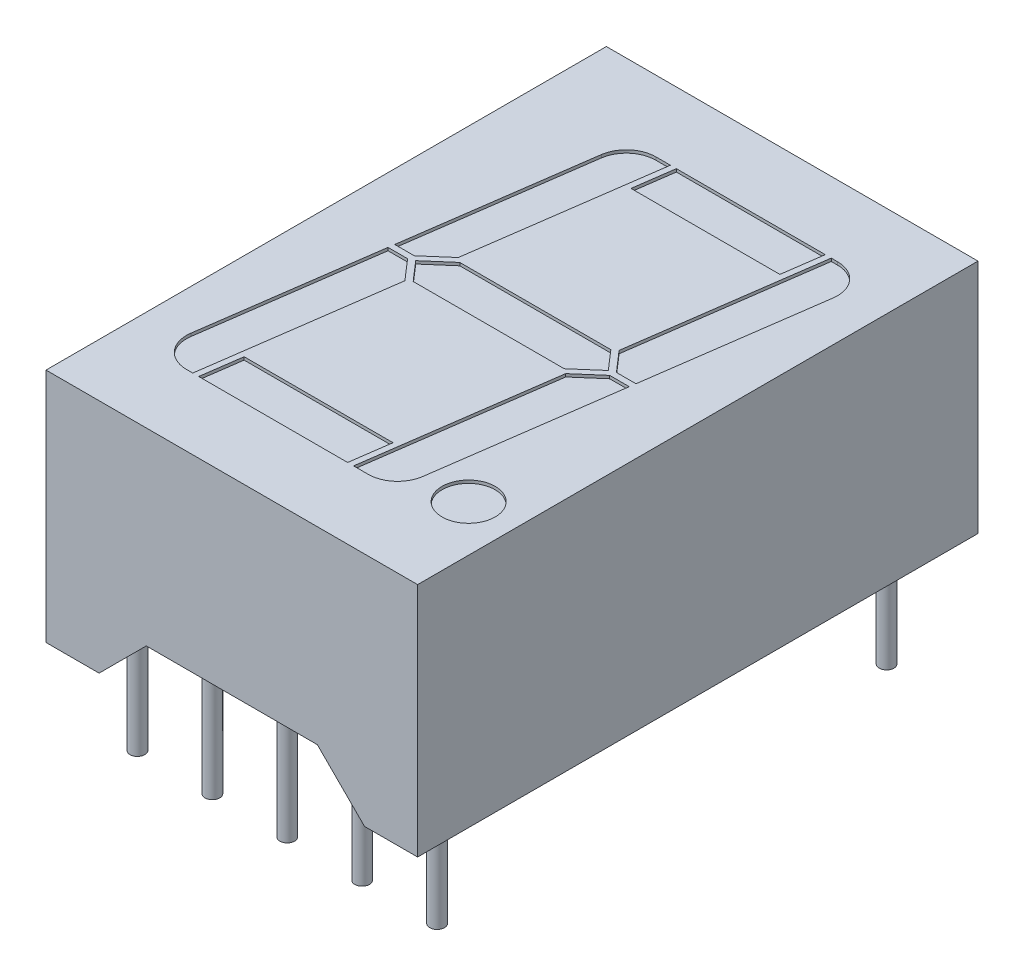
ISO-10303-21;
HEADER;
FILE_DESCRIPTION(('STEP AP214'),'2;1');
FILE_NAME('part.step','',(''),(''),'','','');
FILE_SCHEMA(('AUTOMOTIVE_DESIGN { 1 0 10303 214 1 1 1 1 }'));
ENDSEC;
DATA;
#1=APPLICATION_CONTEXT('core data for automotive mechanical design processes');
#2=APPLICATION_PROTOCOL_DEFINITION('international standard','automotive_design',2000,#1);
#3=PRODUCT_CONTEXT('',#1,'mechanical');
#4=PRODUCT('Part','Part','',(#3));
#5=PRODUCT_RELATED_PRODUCT_CATEGORY('part','',(#4));
#6=PRODUCT_DEFINITION_FORMATION('','',#4);
#7=PRODUCT_DEFINITION_CONTEXT('part definition',#1,'design');
#8=PRODUCT_DEFINITION('design','',#6,#7);
#9=PRODUCT_DEFINITION_SHAPE('','',#8);
#10=(LENGTH_UNIT() NAMED_UNIT(*) SI_UNIT(.MILLI.,.METRE.));
#11=(NAMED_UNIT(*) PLANE_ANGLE_UNIT() SI_UNIT($,.RADIAN.));
#12=(NAMED_UNIT(*) SI_UNIT($,.STERADIAN.) SOLID_ANGLE_UNIT());
#13=UNCERTAINTY_MEASURE_WITH_UNIT(LENGTH_MEASURE(1.E-05),#10,'distance_accuracy_value','');
#14=(GEOMETRIC_REPRESENTATION_CONTEXT(3) GLOBAL_UNCERTAINTY_ASSIGNED_CONTEXT((#13)) GLOBAL_UNIT_ASSIGNED_CONTEXT((#10,
#11,#12)) REPRESENTATION_CONTEXT('',''));
#15=CARTESIAN_POINT('',(0.,0.,0.));
#16=DIRECTION('',(0.,0.,1.));
#17=DIRECTION('',(1.,0.,0.));
#18=AXIS2_PLACEMENT_3D('',#15,#16,#17);
#19=CARTESIAN_POINT('',(6.3,0.,9.5));
#20=DIRECTION('',(0.,1.,0.));
#21=DIRECTION('',(-1.,0.,0.));
#22=AXIS2_PLACEMENT_3D('',#19,#20,#21);
#23=PLANE('',#22);
#24=CARTESIAN_POINT('',(5.08,0.,-7.62));
#25=DIRECTION('',(0.,1.,0.));
#26=DIRECTION('',(-1.,0.,0.));
#27=AXIS2_PLACEMENT_3D('',#24,#25,#26);
#28=CIRCLE('',#27,0.25);
#29=CARTESIAN_POINT('',(4.83,0.,-7.62));
#30=VERTEX_POINT('',#29);
#31=EDGE_CURVE('E896',#30,#30,#28,.F.);
#32=ORIENTED_EDGE('',*,*,#31,.F.);
#33=EDGE_LOOP('',(#32));
#34=FACE_BOUND('',#33,.T.);
#35=DIRECTION('',(1.,0.,0.));
#36=VECTOR('',#35,1.);
#37=CARTESIAN_POINT('',(6.3,0.,-9.5));
#38=LINE('',#37,#36);
#39=CARTESIAN_POINT('',(4.5,0.,-9.5));
#40=VERTEX_POINT('',#39);
#41=CARTESIAN_POINT('',(6.3,0.,-9.5));
#42=VERTEX_POINT('',#41);
#43=EDGE_CURVE('E842',#40,#42,#38,.T.);
#44=ORIENTED_EDGE('',*,*,#43,.T.);
#45=DIRECTION('',(0.,0.,-1.));
#46=VECTOR('',#45,1.);
#47=CARTESIAN_POINT('',(6.3,0.,9.5));
#48=LINE('',#47,#46);
#49=CARTESIAN_POINT('',(6.3,0.,9.5));
#50=VERTEX_POINT('',#49);
#51=EDGE_CURVE('E857',#50,#42,#48,.T.);
#52=ORIENTED_EDGE('',*,*,#51,.F.);
#53=DIRECTION('',(1.,0.,0.));
#54=VECTOR('',#53,1.);
#55=CARTESIAN_POINT('',(6.3,0.,9.5));
#56=LINE('',#55,#54);
#57=CARTESIAN_POINT('',(4.5,0.,9.5));
#58=VERTEX_POINT('',#57);
#59=EDGE_CURVE('E817',#58,#50,#56,.T.);
#60=ORIENTED_EDGE('',*,*,#59,.F.);
#61=DIRECTION('',(0.,0.,-1.));
#62=VECTOR('',#61,1.);
#63=CARTESIAN_POINT('',(4.5,0.,9.5));
#64=LINE('',#63,#62);
#65=EDGE_CURVE('E861',#58,#40,#64,.T.);
#66=ORIENTED_EDGE('',*,*,#65,.T.);
#67=EDGE_LOOP('',(#44,#52,#60,#66));
#68=FACE_BOUND('',#67,.T.);
#69=CARTESIAN_POINT('',(5.08,0.,7.62));
#70=DIRECTION('',(0.,1.,0.));
#71=DIRECTION('',(-1.,0.,0.));
#72=AXIS2_PLACEMENT_3D('',#69,#70,#71);
#73=CIRCLE('',#72,0.250000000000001);
#74=CARTESIAN_POINT('',(4.83,0.,7.62));
#75=VERTEX_POINT('',#74);
#76=EDGE_CURVE('E11',#75,#75,#73,.F.);
#77=ORIENTED_EDGE('',*,*,#76,.F.);
#78=EDGE_LOOP('',(#77));
#79=FACE_BOUND('',#78,.T.);
#80=ADVANCED_FACE('F38',(#34,#68,#79),#23,.F.);
#81=CARTESIAN_POINT('',(-2.89999999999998,1.6,9.5));
#82=DIRECTION('',(0.,1.,0.));
#83=DIRECTION('',(-1.,0.,0.));
#84=AXIS2_PLACEMENT_3D('',#81,#82,#83);
#85=PLANE('',#84);
#86=CARTESIAN_POINT('',(0.,1.6,7.62));
#87=DIRECTION('',(0.,1.,0.));
#88=DIRECTION('',(-1.,0.,0.));
#89=AXIS2_PLACEMENT_3D('',#86,#87,#88);
#90=CIRCLE('',#89,0.250000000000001);
#91=CARTESIAN_POINT('',(-0.250000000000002,1.6,7.62));
#92=VERTEX_POINT('',#91);
#93=EDGE_CURVE('E908',#92,#92,#90,.F.);
#94=ORIENTED_EDGE('',*,*,#93,.F.);
#95=EDGE_LOOP('',(#94));
#96=FACE_BOUND('',#95,.T.);
#97=CARTESIAN_POINT('',(2.54,1.6,-7.62));
#98=DIRECTION('',(0.,1.,0.));
#99=DIRECTION('',(-1.,0.,0.));
#100=AXIS2_PLACEMENT_3D('',#97,#98,#99);
#101=CIRCLE('',#100,0.25);
#102=CARTESIAN_POINT('',(2.29,1.6,-7.62));
#103=VERTEX_POINT('',#102);
#104=EDGE_CURVE('E892',#103,#103,#101,.F.);
#105=ORIENTED_EDGE('',*,*,#104,.F.);
#106=EDGE_LOOP('',(#105));
#107=FACE_BOUND('',#106,.T.);
#108=CARTESIAN_POINT('',(-2.54,1.6,-7.62));
#109=DIRECTION('',(0.,1.,0.));
#110=DIRECTION('',(-1.,0.,0.));
#111=AXIS2_PLACEMENT_3D('',#108,#109,#110);
#112=CIRCLE('',#111,0.25);
#113=CARTESIAN_POINT('',(-2.79,1.6,-7.62));
#114=VERTEX_POINT('',#113);
#115=EDGE_CURVE('E885',#114,#114,#112,.F.);
#116=ORIENTED_EDGE('',*,*,#115,.F.);
#117=EDGE_LOOP('',(#116));
#118=FACE_BOUND('',#117,.T.);
#119=DIRECTION('',(1.,0.,0.));
#120=VECTOR('',#119,1.);
#121=CARTESIAN_POINT('',(-2.89999999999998,1.6,-9.5));
#122=LINE('',#121,#120);
#123=CARTESIAN_POINT('',(-2.89999999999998,1.6,-9.5));
#124=VERTEX_POINT('',#123);
#125=CARTESIAN_POINT('',(2.89999999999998,1.6,-9.5));
#126=VERTEX_POINT('',#125);
#127=EDGE_CURVE('E836',#124,#126,#122,.T.);
#128=ORIENTED_EDGE('',*,*,#127,.T.);
#129=DIRECTION('',(0.,0.,-1.));
#130=VECTOR('',#129,1.);
#131=CARTESIAN_POINT('',(2.89999999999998,1.6,9.5));
#132=LINE('',#131,#130);
#133=CARTESIAN_POINT('',(2.89999999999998,1.6,9.5));
#134=VERTEX_POINT('',#133);
#135=EDGE_CURVE('E865',#134,#126,#132,.T.);
#136=ORIENTED_EDGE('',*,*,#135,.F.);
#137=DIRECTION('',(1.,0.,0.));
#138=VECTOR('',#137,1.);
#139=CARTESIAN_POINT('',(-2.89999999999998,1.6,9.5));
#140=LINE('',#139,#138);
#141=CARTESIAN_POINT('',(-2.89999999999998,1.6,9.5));
#142=VERTEX_POINT('',#141);
#143=EDGE_CURVE('E811',#142,#134,#140,.T.);
#144=ORIENTED_EDGE('',*,*,#143,.F.);
#145=DIRECTION('',(0.,0.,-1.));
#146=VECTOR('',#145,1.);
#147=CARTESIAN_POINT('',(-2.89999999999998,1.6,9.5));
#148=LINE('',#147,#146);
#149=EDGE_CURVE('E869',#142,#124,#148,.T.);
#150=ORIENTED_EDGE('',*,*,#149,.T.);
#151=EDGE_LOOP('',(#128,#136,#144,#150));
#152=FACE_BOUND('',#151,.T.);
#153=CARTESIAN_POINT('',(0.,1.6,-7.62));
#154=DIRECTION('',(0.,1.,0.));
#155=DIRECTION('',(-1.,0.,0.));
#156=AXIS2_PLACEMENT_3D('',#153,#154,#155);
#157=CIRCLE('',#156,0.250000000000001);
#158=CARTESIAN_POINT('',(-0.250000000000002,1.6,-7.62));
#159=VERTEX_POINT('',#158);
#160=EDGE_CURVE('E888',#159,#159,#157,.F.);
#161=ORIENTED_EDGE('',*,*,#160,.F.);
#162=EDGE_LOOP('',(#161));
#163=FACE_BOUND('',#162,.T.);
#164=CARTESIAN_POINT('',(-2.54,1.6,7.62));
#165=DIRECTION('',(0.,1.,0.));
#166=DIRECTION('',(-1.,0.,0.));
#167=AXIS2_PLACEMENT_3D('',#164,#165,#166);
#168=CIRCLE('',#167,0.250000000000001);
#169=CARTESIAN_POINT('',(-2.79,1.6,7.62));
#170=VERTEX_POINT('',#169);
#171=EDGE_CURVE('E904',#170,#170,#168,.F.);
#172=ORIENTED_EDGE('',*,*,#171,.F.);
#173=EDGE_LOOP('',(#172));
#174=FACE_BOUND('',#173,.T.);
#175=CARTESIAN_POINT('',(2.54,1.6,7.62));
#176=DIRECTION('',(0.,1.,0.));
#177=DIRECTION('',(-1.,0.,0.));
#178=AXIS2_PLACEMENT_3D('',#175,#176,#177);
#179=CIRCLE('',#178,0.250000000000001);
#180=CARTESIAN_POINT('',(2.29,1.6,7.62));
#181=VERTEX_POINT('',#180);
#182=EDGE_CURVE('E47',#181,#181,#179,.F.);
#183=ORIENTED_EDGE('',*,*,#182,.F.);
#184=EDGE_LOOP('',(#183));
#185=FACE_BOUND('',#184,.T.);
#186=ADVANCED_FACE('F917',(#96,#107,#118,#152,#163,#174,#185),#85,.F.);
#187=CARTESIAN_POINT('',(-6.3,0.,9.5));
#188=DIRECTION('',(0.,1.,0.));
#189=DIRECTION('',(0.,0.,1.));
#190=AXIS2_PLACEMENT_3D('',#187,#188,#189);
#191=PLANE('',#190);
#192=CARTESIAN_POINT('',(-5.08,0.,-7.62));
#193=DIRECTION('',(0.,1.,0.));
#194=DIRECTION('',(0.,0.,1.));
#195=AXIS2_PLACEMENT_3D('',#192,#193,#194);
#196=CIRCLE('',#195,0.25);
#197=CARTESIAN_POINT('',(-5.08,0.,-7.37));
#198=VERTEX_POINT('',#197);
#199=EDGE_CURVE('E881',#198,#198,#196,.F.);
#200=ORIENTED_EDGE('',*,*,#199,.F.);
#201=EDGE_LOOP('',(#200));
#202=FACE_BOUND('',#201,.T.);
#203=DIRECTION('',(1.,0.,0.));
#204=VECTOR('',#203,1.);
#205=CARTESIAN_POINT('',(-6.3,0.,-9.5));
#206=LINE('',#205,#204);
#207=CARTESIAN_POINT('',(-6.3,0.,-9.5));
#208=VERTEX_POINT('',#207);
#209=CARTESIAN_POINT('',(-4.5,0.,-9.5));
#210=VERTEX_POINT('',#209);
#211=EDGE_CURVE('E830',#208,#210,#206,.T.);
#212=ORIENTED_EDGE('',*,*,#211,.T.);
#213=DIRECTION('',(0.,0.,-1.));
#214=VECTOR('',#213,1.);
#215=CARTESIAN_POINT('',(-4.5,0.,9.5));
#216=LINE('',#215,#214);
#217=CARTESIAN_POINT('',(-4.5,0.,9.5));
#218=VERTEX_POINT('',#217);
#219=EDGE_CURVE('E873',#218,#210,#216,.T.);
#220=ORIENTED_EDGE('',*,*,#219,.F.);
#221=DIRECTION('',(1.,0.,0.));
#222=VECTOR('',#221,1.);
#223=CARTESIAN_POINT('',(-6.3,0.,9.5));
#224=LINE('',#223,#222);
#225=CARTESIAN_POINT('',(-6.3,0.,9.5));
#226=VERTEX_POINT('',#225);
#227=EDGE_CURVE('E804',#226,#218,#224,.T.);
#228=ORIENTED_EDGE('',*,*,#227,.F.);
#229=DIRECTION('',(0.,0.,-1.));
#230=VECTOR('',#229,1.);
#231=CARTESIAN_POINT('',(-6.3,0.,9.5));
#232=LINE('',#231,#230);
#233=EDGE_CURVE('E877',#226,#208,#232,.T.);
#234=ORIENTED_EDGE('',*,*,#233,.T.);
#235=EDGE_LOOP('',(#212,#220,#228,#234));
#236=FACE_BOUND('',#235,.T.);
#237=CARTESIAN_POINT('',(-5.08,0.,7.62));
#238=DIRECTION('',(0.,1.,0.));
#239=DIRECTION('',(0.,0.,1.));
#240=AXIS2_PLACEMENT_3D('',#237,#238,#239);
#241=CIRCLE('',#240,0.250000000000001);
#242=CARTESIAN_POINT('',(-5.08,0.,7.87));
#243=VERTEX_POINT('',#242);
#244=EDGE_CURVE('E900',#243,#243,#241,.F.);
#245=ORIENTED_EDGE('',*,*,#244,.F.);
#246=EDGE_LOOP('',(#245));
#247=FACE_BOUND('',#246,.T.);
#248=ADVANCED_FACE('F919',(#202,#236,#247),#191,.F.);
#249=CARTESIAN_POINT('',(-6.3,0.,9.5));
#250=DIRECTION('',(1.,0.,0.));
#251=DIRECTION('',(0.,0.,-1.));
#252=AXIS2_PLACEMENT_3D('',#249,#250,#251);
#253=PLANE('',#252);
#254=DIRECTION('',(0.,-1.,0.));
#255=VECTOR('',#254,1.);
#256=CARTESIAN_POINT('',(-6.3,0.,-9.5));
#257=LINE('',#256,#255);
#258=CARTESIAN_POINT('',(-6.3,8.,-9.5));
#259=VERTEX_POINT('',#258);
#260=EDGE_CURVE('E799',#259,#208,#257,.T.);
#261=ORIENTED_EDGE('',*,*,#260,.T.);
#262=ORIENTED_EDGE('',*,*,#233,.F.);
#263=DIRECTION('',(0.,-1.,0.));
#264=VECTOR('',#263,1.);
#265=CARTESIAN_POINT('',(-6.3,0.,9.5));
#266=LINE('',#265,#264);
#267=CARTESIAN_POINT('',(-6.3,8.,9.5));
#268=VERTEX_POINT('',#267);
#269=EDGE_CURVE('E800',#268,#226,#266,.T.);
#270=ORIENTED_EDGE('',*,*,#269,.F.);
#271=DIRECTION('',(0.,0.,-1.));
#272=VECTOR('',#271,1.);
#273=CARTESIAN_POINT('',(-6.3,8.,9.5));
#274=LINE('',#273,#272);
#275=EDGE_CURVE('E826',#268,#259,#274,.T.);
#276=ORIENTED_EDGE('',*,*,#275,.T.);
#277=EDGE_LOOP('',(#261,#262,#270,#276));
#278=FACE_BOUND('',#277,.T.);
#279=ADVANCED_FACE('F40',(#278),#253,.F.);
#280=CARTESIAN_POINT('',(-4.5,0.,9.5));
#281=DIRECTION('',(-0.707106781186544,0.707106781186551,0.));
#282=DIRECTION('',(-0.707106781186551,-0.707106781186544,0.));
#283=AXIS2_PLACEMENT_3D('',#280,#281,#282);
#284=PLANE('',#283);
#285=DIRECTION('',(0.707106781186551,0.707106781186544,0.));
#286=VECTOR('',#285,1.);
#287=CARTESIAN_POINT('',(-4.5,0.,-9.5));
#288=LINE('',#287,#286);
#289=EDGE_CURVE('E833',#210,#124,#288,.T.);
#290=ORIENTED_EDGE('',*,*,#289,.T.);
#291=ORIENTED_EDGE('',*,*,#149,.F.);
#292=DIRECTION('',(0.707106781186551,0.707106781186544,0.));
#293=VECTOR('',#292,1.);
#294=CARTESIAN_POINT('',(-4.5,0.,9.5));
#295=LINE('',#294,#293);
#296=EDGE_CURVE('E808',#218,#142,#295,.T.);
#297=ORIENTED_EDGE('',*,*,#296,.F.);
#298=ORIENTED_EDGE('',*,*,#219,.T.);
#299=EDGE_LOOP('',(#290,#291,#297,#298));
#300=FACE_BOUND('',#299,.T.);
#301=ADVANCED_FACE('F934',(#300),#284,.F.);
#302=CARTESIAN_POINT('',(4.5,0.,9.5));
#303=DIRECTION('',(0.707106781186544,0.707106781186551,0.));
#304=DIRECTION('',(-0.707106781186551,0.707106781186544,0.));
#305=AXIS2_PLACEMENT_3D('',#302,#303,#304);
#306=PLANE('',#305);
#307=DIRECTION('',(0.707106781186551,-0.707106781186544,0.));
#308=VECTOR('',#307,1.);
#309=CARTESIAN_POINT('',(4.5,0.,-9.5));
#310=LINE('',#309,#308);
#311=EDGE_CURVE('E839',#126,#40,#310,.T.);
#312=ORIENTED_EDGE('',*,*,#311,.T.);
#313=ORIENTED_EDGE('',*,*,#65,.F.);
#314=DIRECTION('',(0.707106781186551,-0.707106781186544,0.));
#315=VECTOR('',#314,1.);
#316=CARTESIAN_POINT('',(4.5,0.,9.5));
#317=LINE('',#316,#315);
#318=EDGE_CURVE('E814',#134,#58,#317,.T.);
#319=ORIENTED_EDGE('',*,*,#318,.F.);
#320=ORIENTED_EDGE('',*,*,#135,.T.);
#321=EDGE_LOOP('',(#312,#313,#319,#320));
#322=FACE_BOUND('',#321,.T.);
#323=ADVANCED_FACE('F933',(#322),#306,.F.);
#324=CARTESIAN_POINT('',(6.3,0.,9.5));
#325=DIRECTION('',(-1.,0.,0.));
#326=DIRECTION('',(0.,-1.,0.));
#327=AXIS2_PLACEMENT_3D('',#324,#325,#326);
#328=PLANE('',#327);
#329=DIRECTION('',(0.,1.,0.));
#330=VECTOR('',#329,1.);
#331=CARTESIAN_POINT('',(6.3,0.,-9.5));
#332=LINE('',#331,#330);
#333=CARTESIAN_POINT('',(6.3,8.,-9.5));
#334=VERTEX_POINT('',#333);
#335=EDGE_CURVE('E845',#42,#334,#332,.T.);
#336=ORIENTED_EDGE('',*,*,#335,.T.);
#337=DIRECTION('',(0.,0.,-1.));
#338=VECTOR('',#337,1.);
#339=CARTESIAN_POINT('',(6.3,8.,9.5));
#340=LINE('',#339,#338);
#341=CARTESIAN_POINT('',(6.3,8.,9.5));
#342=VERTEX_POINT('',#341);
#343=EDGE_CURVE('E853',#342,#334,#340,.T.);
#344=ORIENTED_EDGE('',*,*,#343,.F.);
#345=DIRECTION('',(0.,1.,0.));
#346=VECTOR('',#345,1.);
#347=CARTESIAN_POINT('',(6.3,0.,9.5));
#348=LINE('',#347,#346);
#349=EDGE_CURVE('E820',#50,#342,#348,.T.);
#350=ORIENTED_EDGE('',*,*,#349,.F.);
#351=ORIENTED_EDGE('',*,*,#51,.T.);
#352=EDGE_LOOP('',(#336,#344,#350,#351));
#353=FACE_BOUND('',#352,.T.);
#354=ADVANCED_FACE('F941',(#353),#328,.F.);
#355=CARTESIAN_POINT('',(-6.3,8.,9.5));
#356=DIRECTION('',(0.,-1.,0.));
#357=DIRECTION('',(1.,0.,0.));
#358=AXIS2_PLACEMENT_3D('',#355,#356,#357);
#359=PLANE('',#358);
#360=CARTESIAN_POINT('',(4.72869451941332,8.,6.2));
#361=DIRECTION('',(0.,1.,0.));
#362=DIRECTION('',(-1.,0.,0.));
#363=AXIS2_PLACEMENT_3D('',#360,#361,#362);
#364=CIRCLE('',#363,0.9);
#365=CARTESIAN_POINT('',(3.82869451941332,8.,6.2));
#366=VERTEX_POINT('',#365);
#367=EDGE_CURVE('E365',#366,#366,#364,.T.);
#368=ORIENTED_EDGE('',*,*,#367,.F.);
#369=EDGE_LOOP('',(#368));
#370=FACE_BOUND('',#369,.T.);
#371=DIRECTION('',(1.,0.,0.));
#372=VECTOR('',#371,1.);
#373=CARTESIAN_POINT('',(2.44616791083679,8.,0.675));
#374=LINE('',#373,#372);
#375=CARTESIAN_POINT('',(-2.67574605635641,8.,0.675));
#376=VERTEX_POINT('',#375);
#377=CARTESIAN_POINT('',(2.44616791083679,8.,0.675));
#378=VERTEX_POINT('',#377);
#379=EDGE_CURVE('E381',#376,#378,#374,.T.);
#380=ORIENTED_EDGE('',*,*,#379,.F.);
#381=DIRECTION('',(0.65605902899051,0.,0.75470958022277));
#382=VECTOR('',#381,1.);
#383=CARTESIAN_POINT('',(-3.24536348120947,8.,0.0197301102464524));
#384=LINE('',#383,#382);
#385=CARTESIAN_POINT('',(-3.24536348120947,8.,0.0197301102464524));
#386=VERTEX_POINT('',#385);
#387=EDGE_CURVE('E54',#386,#376,#384,.T.);
#388=ORIENTED_EDGE('',*,*,#387,.F.);
#389=DIRECTION('',(-0.75470958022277,0.,0.656059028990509));
#390=VECTOR('',#389,1.);
#391=CARTESIAN_POINT('',(-2.44616791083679,8.,-0.675));
#392=LINE('',#391,#390);
#393=CARTESIAN_POINT('',(-2.44616791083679,8.,-0.675));
#394=VERTEX_POINT('',#393);
#395=EDGE_CURVE('E356',#394,#386,#392,.T.);
#396=ORIENTED_EDGE('',*,*,#395,.F.);
#397=DIRECTION('',(-1.,0.,0.));
#398=VECTOR('',#397,1.);
#399=CARTESIAN_POINT('',(-2.44616791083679,8.,-0.675));
#400=LINE('',#399,#398);
#401=CARTESIAN_POINT('',(2.67574605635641,8.,-0.675));
#402=VERTEX_POINT('',#401);
#403=EDGE_CURVE('E362',#402,#394,#400,.T.);
#404=ORIENTED_EDGE('',*,*,#403,.F.);
#405=DIRECTION('',(-0.656059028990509,0.,-0.75470958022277));
#406=VECTOR('',#405,1.);
#407=CARTESIAN_POINT('',(3.24536348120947,8.,-0.0197301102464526));
#408=LINE('',#407,#406);
#409=CARTESIAN_POINT('',(3.24536348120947,8.,-0.0197301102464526));
#410=VERTEX_POINT('',#409);
#411=EDGE_CURVE('E389',#410,#402,#408,.T.);
#412=ORIENTED_EDGE('',*,*,#411,.F.);
#413=DIRECTION('',(0.75470958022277,0.,-0.656059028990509));
#414=VECTOR('',#413,1.);
#415=CARTESIAN_POINT('',(2.44616791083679,8.,0.675));
#416=LINE('',#415,#414);
#417=EDGE_CURVE('E385',#378,#410,#416,.T.);
#418=ORIENTED_EDGE('',*,*,#417,.F.);
#419=EDGE_LOOP('',(#380,#388,#396,#404,#412,#418));
#420=FACE_BOUND('',#419,.T.);
#421=DIRECTION('',(1.,0.,0.));
#422=VECTOR('',#421,1.);
#423=CARTESIAN_POINT('',(-1.71645913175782,8.,-5.75));
#424=LINE('',#423,#422);
#425=CARTESIAN_POINT('',(-1.71645913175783,8.,-5.75));
#426=VERTEX_POINT('',#425);
#427=CARTESIAN_POINT('',(3.33267873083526,8.,-5.75));
#428=VERTEX_POINT('',#427);
#429=EDGE_CURVE('E430',#426,#428,#424,.T.);
#430=ORIENTED_EDGE('',*,*,#429,.F.);
#431=DIRECTION('',(-0.13917310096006,0.,0.990268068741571));
#432=VECTOR('',#431,1.);
#433=CARTESIAN_POINT('',(-1.71645913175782,8.,-5.75));
#434=LINE('',#433,#432);
#435=CARTESIAN_POINT('',(-1.5267290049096,8.,-7.1));
#436=VERTEX_POINT('',#435);
#437=EDGE_CURVE('E62',#436,#426,#434,.T.);
#438=ORIENTED_EDGE('',*,*,#437,.F.);
#439=DIRECTION('',(-1.,0.,0.));
#440=VECTOR('',#439,1.);
#441=CARTESIAN_POINT('',(-1.5267290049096,8.,-7.1));
#442=LINE('',#441,#440);
#443=CARTESIAN_POINT('',(3.52240885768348,8.,-7.1));
#444=VERTEX_POINT('',#443);
#445=EDGE_CURVE('E415',#444,#436,#442,.T.);
#446=ORIENTED_EDGE('',*,*,#445,.F.);
#447=DIRECTION('',(0.13917310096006,0.,-0.990268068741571));
#448=VECTOR('',#447,1.);
#449=CARTESIAN_POINT('',(3.33267873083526,8.,-5.75));
#450=LINE('',#449,#448);
#451=EDGE_CURVE('E434',#428,#444,#450,.T.);
#452=ORIENTED_EDGE('',*,*,#451,.F.);
#453=EDGE_LOOP('',(#430,#438,#446,#452));
#454=FACE_BOUND('',#453,.T.);
#455=DIRECTION('',(0.13917310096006,0.,-0.990268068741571));
#456=VECTOR('',#455,1.);
#457=CARTESIAN_POINT('',(1.71645913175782,8.,5.75));
#458=LINE('',#457,#456);
#459=CARTESIAN_POINT('',(1.5267290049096,8.,7.1));
#460=VERTEX_POINT('',#459);
#461=CARTESIAN_POINT('',(1.71645913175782,8.,5.75));
#462=VERTEX_POINT('',#461);
#463=EDGE_CURVE('E473',#460,#462,#458,.T.);
#464=ORIENTED_EDGE('',*,*,#463,.F.);
#465=DIRECTION('',(1.,0.,0.));
#466=VECTOR('',#465,1.);
#467=CARTESIAN_POINT('',(1.5267290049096,8.,7.1));
#468=LINE('',#467,#466);
#469=CARTESIAN_POINT('',(-3.52240885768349,8.,7.1));
#470=VERTEX_POINT('',#469);
#471=EDGE_CURVE('E444',#470,#460,#468,.T.);
#472=ORIENTED_EDGE('',*,*,#471,.F.);
#473=DIRECTION('',(-0.13917310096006,0.,0.990268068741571));
#474=VECTOR('',#473,1.);
#475=CARTESIAN_POINT('',(-3.52240885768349,8.,7.1));
#476=LINE('',#475,#474);
#477=CARTESIAN_POINT('',(-3.33267873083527,8.,5.75));
#478=VERTEX_POINT('',#477);
#479=EDGE_CURVE('E458',#478,#470,#476,.T.);
#480=ORIENTED_EDGE('',*,*,#479,.F.);
#481=DIRECTION('',(-1.,0.,0.));
#482=VECTOR('',#481,1.);
#483=CARTESIAN_POINT('',(-3.33267873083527,8.,5.75));
#484=LINE('',#483,#482);
#485=EDGE_CURVE('E477',#462,#478,#484,.T.);
#486=ORIENTED_EDGE('',*,*,#485,.F.);
#487=EDGE_LOOP('',(#464,#472,#480,#486));
#488=FACE_BOUND('',#487,.T.);
#489=CARTESIAN_POINT('',(2.22267500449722,8.,6.1));
#490=DIRECTION('',(0.,1.,0.));
#491=DIRECTION('',(1.,0.,0.));
#492=AXIS2_PLACEMENT_3D('',#489,#490,#491);
#493=CIRCLE('',#492,1.);
#494=CARTESIAN_POINT('',(2.22267500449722,8.,7.1));
#495=VERTEX_POINT('',#494);
#496=CARTESIAN_POINT('',(3.2129430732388,8.,6.23917310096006));
#497=VERTEX_POINT('',#496);
#498=EDGE_CURVE('E524',#495,#497,#493,.T.);
#499=ORIENTED_EDGE('',*,*,#498,.F.);
#500=DIRECTION('',(1.,0.,0.));
#501=VECTOR('',#500,1.);
#502=CARTESIAN_POINT('',(2.22267500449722,8.,7.1));
#503=LINE('',#502,#501);
#504=CARTESIAN_POINT('',(1.72869451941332,8.,7.1));
#505=VERTEX_POINT('',#504);
#506=EDGE_CURVE('E487',#505,#495,#503,.T.);
#507=ORIENTED_EDGE('',*,*,#506,.F.);
#508=DIRECTION('',(-0.13917310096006,0.,0.990268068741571));
#509=VECTOR('',#508,1.);
#510=CARTESIAN_POINT('',(1.72869451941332,8.,7.1));
#511=LINE('',#510,#509);
#512=CARTESIAN_POINT('',(2.61505919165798,8.,0.7931876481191));
#513=VERTEX_POINT('',#512);
#514=EDGE_CURVE('E502',#513,#505,#511,.T.);
#515=ORIENTED_EDGE('',*,*,#514,.F.);
#516=DIRECTION('',(-0.75470958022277,0.,0.656059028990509));
#517=VECTOR('',#516,1.);
#518=CARTESIAN_POINT('',(2.61505919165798,8.,0.7931876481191));
#519=LINE('',#518,#517);
#520=CARTESIAN_POINT('',(3.41248036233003,8.,0.1));
#521=VERTEX_POINT('',#520);
#522=EDGE_CURVE('E536',#521,#513,#519,.T.);
#523=ORIENTED_EDGE('',*,*,#522,.F.);
#524=DIRECTION('',(-1.,0.,0.));
#525=VECTOR('',#524,1.);
#526=CARTESIAN_POINT('',(3.41248036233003,8.,0.1));
#527=LINE('',#526,#525);
#528=CARTESIAN_POINT('',(4.07574758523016,8.,0.1));
#529=VERTEX_POINT('',#528);
#530=EDGE_CURVE('E532',#529,#521,#527,.T.);
#531=ORIENTED_EDGE('',*,*,#530,.F.);
#532=DIRECTION('',(0.139173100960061,0.,-0.990268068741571));
#533=VECTOR('',#532,1.);
#534=CARTESIAN_POINT('',(4.07574758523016,8.,0.1));
#535=LINE('',#534,#533);
#536=EDGE_CURVE('E528',#497,#529,#535,.T.);
#537=ORIENTED_EDGE('',*,*,#536,.F.);
#538=EDGE_LOOP('',(#499,#507,#515,#523,#531,#537));
#539=FACE_BOUND('',#538,.T.);
#540=DIRECTION('',(-0.139173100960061,0.,0.990268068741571));
#541=VECTOR('',#540,1.);
#542=CARTESIAN_POINT('',(2.83800969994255,8.,-0.7931876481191));
#543=LINE('',#542,#541);
#544=CARTESIAN_POINT('',(3.72437437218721,8.,-7.1));
#545=VERTEX_POINT('',#544);
#546=CARTESIAN_POINT('',(2.83800969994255,8.,-0.7931876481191));
#547=VERTEX_POINT('',#546);
#548=EDGE_CURVE('E590',#545,#547,#543,.T.);
#549=ORIENTED_EDGE('',*,*,#548,.F.);
#550=DIRECTION('',(-1.,0.,0.));
#551=VECTOR('',#550,1.);
#552=CARTESIAN_POINT('',(3.72437437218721,8.,-7.1));
#553=LINE('',#552,#551);
#554=CARTESIAN_POINT('',(3.93727318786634,8.,-7.1));
#555=VERTEX_POINT('',#554);
#556=EDGE_CURVE('E546',#555,#545,#553,.T.);
#557=ORIENTED_EDGE('',*,*,#556,.F.);
#558=CARTESIAN_POINT('',(3.93727318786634,8.,-6.1));
#559=DIRECTION('',(0.,1.,0.));
#560=DIRECTION('',(1.,0.,0.));
#561=AXIS2_PLACEMENT_3D('',#558,#559,#560);
#562=CIRCLE('',#561,1.);
#563=CARTESIAN_POINT('',(4.92754125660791,8.,-5.96082689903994));
#564=VERTEX_POINT('',#563);
#565=EDGE_CURVE('E567',#564,#555,#562,.T.);
#566=ORIENTED_EDGE('',*,*,#565,.F.);
#567=DIRECTION('',(0.13917310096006,0.,-0.990268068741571));
#568=VECTOR('',#567,1.);
#569=CARTESIAN_POINT('',(4.92754125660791,8.,-5.96082689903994));
#570=LINE('',#569,#568);
#571=CARTESIAN_POINT('',(4.10385575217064,8.,-0.1));
#572=VERTEX_POINT('',#571);
#573=EDGE_CURVE('E602',#572,#564,#570,.T.);
#574=ORIENTED_EDGE('',*,*,#573,.F.);
#575=DIRECTION('',(1.,0.,0.));
#576=VECTOR('',#575,1.);
#577=CARTESIAN_POINT('',(4.10385575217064,8.,-0.1));
#578=LINE('',#577,#576);
#579=CARTESIAN_POINT('',(3.4405885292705,8.,-0.1));
#580=VERTEX_POINT('',#579);
#581=EDGE_CURVE('E598',#580,#572,#578,.T.);
#582=ORIENTED_EDGE('',*,*,#581,.F.);
#583=DIRECTION('',(0.656059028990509,0.,0.75470958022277));
#584=VECTOR('',#583,1.);
#585=CARTESIAN_POINT('',(3.4405885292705,8.,-0.1));
#586=LINE('',#585,#584);
#587=EDGE_CURVE('E594',#547,#580,#586,.T.);
#588=ORIENTED_EDGE('',*,*,#587,.F.);
#589=EDGE_LOOP('',(#549,#557,#566,#574,#582,#588));
#590=FACE_BOUND('',#589,.T.);
#591=DIRECTION('',(0.75470958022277,0.,-0.656059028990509));
#592=VECTOR('',#591,1.);
#593=CARTESIAN_POINT('',(-2.61505919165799,8.,-0.7931876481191));
#594=LINE('',#593,#592);
#595=CARTESIAN_POINT('',(-3.41248036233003,8.,-0.0999999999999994));
#596=VERTEX_POINT('',#595);
#597=CARTESIAN_POINT('',(-2.61505919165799,8.,-0.7931876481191));
#598=VERTEX_POINT('',#597);
#599=EDGE_CURVE('E656',#596,#598,#594,.T.);
#600=ORIENTED_EDGE('',*,*,#599,.F.);
#601=DIRECTION('',(1.,0.,0.));
#602=VECTOR('',#601,1.);
#603=CARTESIAN_POINT('',(-3.41248036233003,8.,-0.1));
#604=LINE('',#603,#602);
#605=CARTESIAN_POINT('',(-4.07574758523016,8.,-0.1));
#606=VERTEX_POINT('',#605);
#607=EDGE_CURVE('E612',#606,#596,#604,.T.);
#608=ORIENTED_EDGE('',*,*,#607,.F.);
#609=DIRECTION('',(-0.139173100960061,0.,0.990268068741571));
#610=VECTOR('',#609,1.);
#611=CARTESIAN_POINT('',(-4.07574758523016,8.,-0.1));
#612=LINE('',#611,#610);
#613=CARTESIAN_POINT('',(-3.2129430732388,8.,-6.23917310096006));
#614=VERTEX_POINT('',#613);
#615=EDGE_CURVE('E633',#614,#606,#612,.T.);
#616=ORIENTED_EDGE('',*,*,#615,.F.);
#617=CARTESIAN_POINT('',(-2.22267500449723,8.,-6.1));
#618=DIRECTION('',(0.,1.,0.));
#619=DIRECTION('',(1.,0.,0.));
#620=AXIS2_PLACEMENT_3D('',#617,#618,#619);
#621=CIRCLE('',#620,1.);
#622=CARTESIAN_POINT('',(-2.22267500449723,8.,-7.1));
#623=VERTEX_POINT('',#622);
#624=EDGE_CURVE('E668',#623,#614,#621,.T.);
#625=ORIENTED_EDGE('',*,*,#624,.F.);
#626=DIRECTION('',(-1.,0.,0.));
#627=VECTOR('',#626,1.);
#628=CARTESIAN_POINT('',(-2.22267500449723,8.,-7.1));
#629=LINE('',#628,#627);
#630=CARTESIAN_POINT('',(-1.72869451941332,8.,-7.1));
#631=VERTEX_POINT('',#630);
#632=EDGE_CURVE('E664',#631,#623,#629,.T.);
#633=ORIENTED_EDGE('',*,*,#632,.F.);
#634=DIRECTION('',(0.139173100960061,0.,-0.990268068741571));
#635=VECTOR('',#634,1.);
#636=CARTESIAN_POINT('',(-1.72869451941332,8.,-7.1));
#637=LINE('',#636,#635);
#638=EDGE_CURVE('E660',#598,#631,#637,.T.);
#639=ORIENTED_EDGE('',*,*,#638,.F.);
#640=EDGE_LOOP('',(#600,#608,#616,#625,#633,#639));
#641=FACE_BOUND('',#640,.T.);
#642=DIRECTION('',(-0.139173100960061,0.,0.990268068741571));
#643=VECTOR('',#642,1.);
#644=CARTESIAN_POINT('',(-4.92754125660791,8.,5.96082689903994));
#645=LINE('',#644,#643);
#646=CARTESIAN_POINT('',(-4.10385575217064,8.,0.100000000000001));
#647=VERTEX_POINT('',#646);
#648=CARTESIAN_POINT('',(-4.92754125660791,8.,5.96082689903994));
#649=VERTEX_POINT('',#648);
#650=EDGE_CURVE('E722',#647,#649,#645,.T.);
#651=ORIENTED_EDGE('',*,*,#650,.F.);
#652=DIRECTION('',(-1.,0.,0.));
#653=VECTOR('',#652,1.);
#654=CARTESIAN_POINT('',(-4.10385575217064,8.,0.1));
#655=LINE('',#654,#653);
#656=CARTESIAN_POINT('',(-3.44058852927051,8.,0.1));
#657=VERTEX_POINT('',#656);
#658=EDGE_CURVE('E678',#657,#647,#655,.T.);
#659=ORIENTED_EDGE('',*,*,#658,.F.);
#660=DIRECTION('',(-0.656059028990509,0.,-0.75470958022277));
#661=VECTOR('',#660,1.);
#662=CARTESIAN_POINT('',(-3.44058852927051,8.,0.1));
#663=LINE('',#662,#661);
#664=CARTESIAN_POINT('',(-2.83800969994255,8.,0.7931876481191));
#665=VERTEX_POINT('',#664);
#666=EDGE_CURVE('E699',#665,#657,#663,.T.);
#667=ORIENTED_EDGE('',*,*,#666,.F.);
#668=DIRECTION('',(0.139173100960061,0.,-0.990268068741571));
#669=VECTOR('',#668,1.);
#670=CARTESIAN_POINT('',(-2.83800969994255,8.,0.7931876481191));
#671=LINE('',#670,#669);
#672=CARTESIAN_POINT('',(-3.72437437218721,8.,7.1));
#673=VERTEX_POINT('',#672);
#674=EDGE_CURVE('E734',#673,#665,#671,.T.);
#675=ORIENTED_EDGE('',*,*,#674,.F.);
#676=DIRECTION('',(1.,0.,0.));
#677=VECTOR('',#676,1.);
#678=CARTESIAN_POINT('',(-3.72437437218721,8.,7.1));
#679=LINE('',#678,#677);
#680=CARTESIAN_POINT('',(-3.93727318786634,8.,7.1));
#681=VERTEX_POINT('',#680);
#682=EDGE_CURVE('E730',#681,#673,#679,.T.);
#683=ORIENTED_EDGE('',*,*,#682,.F.);
#684=CARTESIAN_POINT('',(-3.93727318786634,8.,6.1));
#685=DIRECTION('',(0.,1.,0.));
#686=DIRECTION('',(-1.,0.,0.));
#687=AXIS2_PLACEMENT_3D('',#684,#685,#686);
#688=CIRCLE('',#687,1.);
#689=EDGE_CURVE('E726',#649,#681,#688,.T.);
#690=ORIENTED_EDGE('',*,*,#689,.F.);
#691=EDGE_LOOP('',(#651,#659,#667,#675,#683,#690));
#692=FACE_BOUND('',#691,.T.);
#693=DIRECTION('',(-1.,0.,0.));
#694=VECTOR('',#693,1.);
#695=CARTESIAN_POINT('',(-6.3,8.,-9.5));
#696=LINE('',#695,#694);
#697=EDGE_CURVE('E805',#334,#259,#696,.T.);
#698=ORIENTED_EDGE('',*,*,#697,.T.);
#699=ORIENTED_EDGE('',*,*,#275,.F.);
#700=DIRECTION('',(-1.,0.,0.));
#701=VECTOR('',#700,1.);
#702=CARTESIAN_POINT('',(-6.3,8.,9.5));
#703=LINE('',#702,#701);
#704=EDGE_CURVE('E823',#342,#268,#703,.T.);
#705=ORIENTED_EDGE('',*,*,#704,.F.);
#706=ORIENTED_EDGE('',*,*,#343,.T.);
#707=EDGE_LOOP('',(#698,#699,#705,#706));
#708=FACE_BOUND('',#707,.T.);
#709=ADVANCED_FACE('F977',(#370,#420,#454,#488,#539,#590,#641,#692,#708),#359,.F.);
#710=CARTESIAN_POINT('',(-6.3,8.,9.5));
#711=DIRECTION('',(0.,0.,-1.));
#712=DIRECTION('',(-1.,0.,0.));
#713=AXIS2_PLACEMENT_3D('',#710,#711,#712);
#714=PLANE('',#713);
#715=ORIENTED_EDGE('',*,*,#269,.T.);
#716=ORIENTED_EDGE('',*,*,#227,.T.);
#717=ORIENTED_EDGE('',*,*,#296,.T.);
#718=ORIENTED_EDGE('',*,*,#143,.T.);
#719=ORIENTED_EDGE('',*,*,#318,.T.);
#720=ORIENTED_EDGE('',*,*,#59,.T.);
#721=ORIENTED_EDGE('',*,*,#349,.T.);
#722=ORIENTED_EDGE('',*,*,#704,.T.);
#723=EDGE_LOOP('',(#715,#716,#717,#718,#719,#720,#721,#722));
#724=FACE_BOUND('',#723,.T.);
#725=ADVANCED_FACE('F967',(#724),#714,.F.);
#726=CARTESIAN_POINT('',(-6.3,8.,-9.5));
#727=DIRECTION('',(0.,0.,-1.));
#728=DIRECTION('',(-1.,0.,0.));
#729=AXIS2_PLACEMENT_3D('',#726,#727,#728);
#730=PLANE('',#729);
#731=ORIENTED_EDGE('',*,*,#260,.F.);
#732=ORIENTED_EDGE('',*,*,#697,.F.);
#733=ORIENTED_EDGE('',*,*,#335,.F.);
#734=ORIENTED_EDGE('',*,*,#43,.F.);
#735=ORIENTED_EDGE('',*,*,#311,.F.);
#736=ORIENTED_EDGE('',*,*,#127,.F.);
#737=ORIENTED_EDGE('',*,*,#289,.F.);
#738=ORIENTED_EDGE('',*,*,#211,.F.);
#739=EDGE_LOOP('',(#731,#732,#733,#734,#735,#736,#737,#738));
#740=FACE_BOUND('',#739,.T.);
#741=ADVANCED_FACE('F956',(#740),#730,.T.);
#742=CARTESIAN_POINT('',(-5.08,2.5,-7.62));
#743=DIRECTION('',(0.,-1.,0.));
#744=DIRECTION('',(0.,0.,-1.));
#745=AXIS2_PLACEMENT_3D('',#742,#743,#744);
#746=CYLINDRICAL_SURFACE('',#745,0.25);
#747=CARTESIAN_POINT('',(-5.08,-3.5,-7.62));
#748=DIRECTION('',(0.,1.,0.));
#749=DIRECTION('',(0.,0.,1.));
#750=AXIS2_PLACEMENT_3D('',#747,#748,#749);
#751=CIRCLE('',#750,0.25);
#752=CARTESIAN_POINT('',(-5.08,-3.5,-7.37));
#753=VERTEX_POINT('',#752);
#754=EDGE_CURVE('E795',#753,#753,#751,.T.);
#755=ORIENTED_EDGE('',*,*,#754,.T.);
#756=EDGE_LOOP('',(#755));
#757=FACE_BOUND('',#756,.T.);
#758=ORIENTED_EDGE('',*,*,#199,.T.);
#759=EDGE_LOOP('',(#758));
#760=FACE_BOUND('',#759,.T.);
#761=ADVANCED_FACE('F989',(#757,#760),#746,.T.);
#762=CARTESIAN_POINT('',(-5.08,-3.5,-7.62));
#763=DIRECTION('',(0.,1.,0.));
#764=DIRECTION('',(0.,0.,1.));
#765=AXIS2_PLACEMENT_3D('',#762,#763,#764);
#766=PLANE('',#765);
#767=ORIENTED_EDGE('',*,*,#754,.F.);
#768=EDGE_LOOP('',(#767));
#769=FACE_BOUND('',#768,.T.);
#770=ADVANCED_FACE('F994',(#769),#766,.F.);
#771=CARTESIAN_POINT('',(-2.54,2.5,-7.62));
#772=DIRECTION('',(0.,-1.,0.));
#773=DIRECTION('',(0.,0.,-1.));
#774=AXIS2_PLACEMENT_3D('',#771,#772,#773);
#775=CYLINDRICAL_SURFACE('',#774,0.25);
#776=CARTESIAN_POINT('',(-2.54,-3.5,-7.62));
#777=DIRECTION('',(0.,1.,0.));
#778=DIRECTION('',(0.,0.,1.));
#779=AXIS2_PLACEMENT_3D('',#776,#777,#778);
#780=CIRCLE('',#779,0.25);
#781=CARTESIAN_POINT('',(-2.54,-3.5,-7.37));
#782=VERTEX_POINT('',#781);
#783=EDGE_CURVE('E791',#782,#782,#780,.T.);
#784=ORIENTED_EDGE('',*,*,#783,.T.);
#785=EDGE_LOOP('',(#784));
#786=FACE_BOUND('',#785,.T.);
#787=ORIENTED_EDGE('',*,*,#115,.T.);
#788=EDGE_LOOP('',(#787));
#789=FACE_BOUND('',#788,.T.);
#790=ADVANCED_FACE('F998',(#786,#789),#775,.T.);
#791=CARTESIAN_POINT('',(-2.54,-3.5,-7.62));
#792=DIRECTION('',(0.,1.,0.));
#793=DIRECTION('',(0.,0.,1.));
#794=AXIS2_PLACEMENT_3D('',#791,#792,#793);
#795=PLANE('',#794);
#796=ORIENTED_EDGE('',*,*,#783,.F.);
#797=EDGE_LOOP('',(#796));
#798=FACE_BOUND('',#797,.T.);
#799=ADVANCED_FACE('F1002',(#798),#795,.F.);
#800=CARTESIAN_POINT('',(0.,2.5,-7.62));
#801=DIRECTION('',(0.,-1.,0.));
#802=DIRECTION('',(0.,0.,-1.));
#803=AXIS2_PLACEMENT_3D('',#800,#801,#802);
#804=CYLINDRICAL_SURFACE('',#803,0.250000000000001);
#805=CARTESIAN_POINT('',(0.,-3.5,-7.62));
#806=DIRECTION('',(0.,1.,0.));
#807=DIRECTION('',(0.,0.,1.));
#808=AXIS2_PLACEMENT_3D('',#805,#806,#807);
#809=CIRCLE('',#808,0.250000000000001);
#810=CARTESIAN_POINT('',(0.,-3.5,-7.37));
#811=VERTEX_POINT('',#810);
#812=EDGE_CURVE('E787',#811,#811,#809,.T.);
#813=ORIENTED_EDGE('',*,*,#812,.T.);
#814=EDGE_LOOP('',(#813));
#815=FACE_BOUND('',#814,.T.);
#816=ORIENTED_EDGE('',*,*,#160,.T.);
#817=EDGE_LOOP('',(#816));
#818=FACE_BOUND('',#817,.T.);
#819=ADVANCED_FACE('F1006',(#815,#818),#804,.T.);
#820=CARTESIAN_POINT('',(0.,-3.5,-7.62));
#821=DIRECTION('',(0.,1.,0.));
#822=DIRECTION('',(0.,0.,1.));
#823=AXIS2_PLACEMENT_3D('',#820,#821,#822);
#824=PLANE('',#823);
#825=ORIENTED_EDGE('',*,*,#812,.F.);
#826=EDGE_LOOP('',(#825));
#827=FACE_BOUND('',#826,.T.);
#828=ADVANCED_FACE('F1010',(#827),#824,.F.);
#829=CARTESIAN_POINT('',(2.54,2.5,-7.62));
#830=DIRECTION('',(0.,-1.,0.));
#831=DIRECTION('',(0.,0.,-1.));
#832=AXIS2_PLACEMENT_3D('',#829,#830,#831);
#833=CYLINDRICAL_SURFACE('',#832,0.25);
#834=CARTESIAN_POINT('',(2.54,-3.5,-7.62));
#835=DIRECTION('',(0.,1.,0.));
#836=DIRECTION('',(0.,0.,1.));
#837=AXIS2_PLACEMENT_3D('',#834,#835,#836);
#838=CIRCLE('',#837,0.25);
#839=CARTESIAN_POINT('',(2.54,-3.5,-7.37));
#840=VERTEX_POINT('',#839);
#841=EDGE_CURVE('E783',#840,#840,#838,.T.);
#842=ORIENTED_EDGE('',*,*,#841,.T.);
#843=EDGE_LOOP('',(#842));
#844=FACE_BOUND('',#843,.T.);
#845=ORIENTED_EDGE('',*,*,#104,.T.);
#846=EDGE_LOOP('',(#845));
#847=FACE_BOUND('',#846,.T.);
#848=ADVANCED_FACE('F1014',(#844,#847),#833,.T.);
#849=CARTESIAN_POINT('',(2.54,-3.5,-7.62));
#850=DIRECTION('',(0.,1.,0.));
#851=DIRECTION('',(0.,0.,1.));
#852=AXIS2_PLACEMENT_3D('',#849,#850,#851);
#853=PLANE('',#852);
#854=ORIENTED_EDGE('',*,*,#841,.F.);
#855=EDGE_LOOP('',(#854));
#856=FACE_BOUND('',#855,.T.);
#857=ADVANCED_FACE('F1018',(#856),#853,.F.);
#858=CARTESIAN_POINT('',(5.08,2.5,-7.62));
#859=DIRECTION('',(0.,-1.,0.));
#860=DIRECTION('',(0.,0.,-1.));
#861=AXIS2_PLACEMENT_3D('',#858,#859,#860);
#862=CYLINDRICAL_SURFACE('',#861,0.25);
#863=CARTESIAN_POINT('',(5.08,-3.5,-7.62));
#864=DIRECTION('',(0.,1.,0.));
#865=DIRECTION('',(0.,0.,1.));
#866=AXIS2_PLACEMENT_3D('',#863,#864,#865);
#867=CIRCLE('',#866,0.25);
#868=CARTESIAN_POINT('',(5.08,-3.5,-7.37));
#869=VERTEX_POINT('',#868);
#870=EDGE_CURVE('E779',#869,#869,#867,.T.);
#871=ORIENTED_EDGE('',*,*,#870,.T.);
#872=EDGE_LOOP('',(#871));
#873=FACE_BOUND('',#872,.T.);
#874=ORIENTED_EDGE('',*,*,#31,.T.);
#875=EDGE_LOOP('',(#874));
#876=FACE_BOUND('',#875,.T.);
#877=ADVANCED_FACE('F1022',(#873,#876),#862,.T.);
#878=CARTESIAN_POINT('',(5.08,-3.5,-7.62));
#879=DIRECTION('',(0.,1.,0.));
#880=DIRECTION('',(0.,0.,1.));
#881=AXIS2_PLACEMENT_3D('',#878,#879,#880);
#882=PLANE('',#881);
#883=ORIENTED_EDGE('',*,*,#870,.F.);
#884=EDGE_LOOP('',(#883));
#885=FACE_BOUND('',#884,.T.);
#886=ADVANCED_FACE('F1026',(#885),#882,.F.);
#887=CARTESIAN_POINT('',(-5.08,2.5,7.62));
#888=DIRECTION('',(0.,-1.,0.));
#889=DIRECTION('',(0.,0.,-1.));
#890=AXIS2_PLACEMENT_3D('',#887,#888,#889);
#891=CYLINDRICAL_SURFACE('',#890,0.250000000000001);
#892=CARTESIAN_POINT('',(-5.08,-3.5,7.62));
#893=DIRECTION('',(0.,1.,0.));
#894=DIRECTION('',(0.,0.,1.));
#895=AXIS2_PLACEMENT_3D('',#892,#893,#894);
#896=CIRCLE('',#895,0.250000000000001);
#897=CARTESIAN_POINT('',(-5.08,-3.5,7.87));
#898=VERTEX_POINT('',#897);
#899=EDGE_CURVE('E775',#898,#898,#896,.T.);
#900=ORIENTED_EDGE('',*,*,#899,.T.);
#901=EDGE_LOOP('',(#900));
#902=FACE_BOUND('',#901,.T.);
#903=ORIENTED_EDGE('',*,*,#244,.T.);
#904=EDGE_LOOP('',(#903));
#905=FACE_BOUND('',#904,.T.);
#906=ADVANCED_FACE('F1030',(#902,#905),#891,.T.);
#907=CARTESIAN_POINT('',(-5.08,-3.5,7.62));
#908=DIRECTION('',(0.,1.,0.));
#909=DIRECTION('',(0.,0.,1.));
#910=AXIS2_PLACEMENT_3D('',#907,#908,#909);
#911=PLANE('',#910);
#912=ORIENTED_EDGE('',*,*,#899,.F.);
#913=EDGE_LOOP('',(#912));
#914=FACE_BOUND('',#913,.T.);
#915=ADVANCED_FACE('F1034',(#914),#911,.F.);
#916=CARTESIAN_POINT('',(-2.54,2.5,7.62));
#917=DIRECTION('',(0.,-1.,0.));
#918=DIRECTION('',(0.,0.,-1.));
#919=AXIS2_PLACEMENT_3D('',#916,#917,#918);
#920=CYLINDRICAL_SURFACE('',#919,0.250000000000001);
#921=CARTESIAN_POINT('',(-2.54,-3.5,7.62));
#922=DIRECTION('',(0.,1.,0.));
#923=DIRECTION('',(0.,0.,1.));
#924=AXIS2_PLACEMENT_3D('',#921,#922,#923);
#925=CIRCLE('',#924,0.250000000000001);
#926=CARTESIAN_POINT('',(-2.54,-3.5,7.87));
#927=VERTEX_POINT('',#926);
#928=EDGE_CURVE('E771',#927,#927,#925,.T.);
#929=ORIENTED_EDGE('',*,*,#928,.T.);
#930=EDGE_LOOP('',(#929));
#931=FACE_BOUND('',#930,.T.);
#932=ORIENTED_EDGE('',*,*,#171,.T.);
#933=EDGE_LOOP('',(#932));
#934=FACE_BOUND('',#933,.T.);
#935=ADVANCED_FACE('F1038',(#931,#934),#920,.T.);
#936=CARTESIAN_POINT('',(-2.54,-3.5,7.62));
#937=DIRECTION('',(0.,1.,0.));
#938=DIRECTION('',(0.,0.,1.));
#939=AXIS2_PLACEMENT_3D('',#936,#937,#938);
#940=PLANE('',#939);
#941=ORIENTED_EDGE('',*,*,#928,.F.);
#942=EDGE_LOOP('',(#941));
#943=FACE_BOUND('',#942,.T.);
#944=ADVANCED_FACE('F1042',(#943),#940,.F.);
#945=CARTESIAN_POINT('',(0.,2.5,7.62));
#946=DIRECTION('',(0.,-1.,0.));
#947=DIRECTION('',(0.,0.,-1.));
#948=AXIS2_PLACEMENT_3D('',#945,#946,#947);
#949=CYLINDRICAL_SURFACE('',#948,0.250000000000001);
#950=CARTESIAN_POINT('',(0.,-3.5,7.62));
#951=DIRECTION('',(0.,1.,0.));
#952=DIRECTION('',(0.,0.,1.));
#953=AXIS2_PLACEMENT_3D('',#950,#951,#952);
#954=CIRCLE('',#953,0.250000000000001);
#955=CARTESIAN_POINT('',(0.,-3.5,7.87));
#956=VERTEX_POINT('',#955);
#957=EDGE_CURVE('E767',#956,#956,#954,.T.);
#958=ORIENTED_EDGE('',*,*,#957,.T.);
#959=EDGE_LOOP('',(#958));
#960=FACE_BOUND('',#959,.T.);
#961=ORIENTED_EDGE('',*,*,#93,.T.);
#962=EDGE_LOOP('',(#961));
#963=FACE_BOUND('',#962,.T.);
#964=ADVANCED_FACE('F1046',(#960,#963),#949,.T.);
#965=CARTESIAN_POINT('',(0.,-3.5,7.62));
#966=DIRECTION('',(0.,1.,0.));
#967=DIRECTION('',(0.,0.,1.));
#968=AXIS2_PLACEMENT_3D('',#965,#966,#967);
#969=PLANE('',#968);
#970=ORIENTED_EDGE('',*,*,#957,.F.);
#971=EDGE_LOOP('',(#970));
#972=FACE_BOUND('',#971,.T.);
#973=ADVANCED_FACE('F1050',(#972),#969,.F.);
#974=CARTESIAN_POINT('',(2.54,2.5,7.62));
#975=DIRECTION('',(0.,-1.,0.));
#976=DIRECTION('',(0.,0.,-1.));
#977=AXIS2_PLACEMENT_3D('',#974,#975,#976);
#978=CYLINDRICAL_SURFACE('',#977,0.250000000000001);
#979=CARTESIAN_POINT('',(2.54,-3.5,7.62));
#980=DIRECTION('',(0.,1.,0.));
#981=DIRECTION('',(0.,0.,1.));
#982=AXIS2_PLACEMENT_3D('',#979,#980,#981);
#983=CIRCLE('',#982,0.250000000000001);
#984=CARTESIAN_POINT('',(2.54,-3.5,7.87));
#985=VERTEX_POINT('',#984);
#986=EDGE_CURVE('E763',#985,#985,#983,.T.);
#987=ORIENTED_EDGE('',*,*,#986,.T.);
#988=EDGE_LOOP('',(#987));
#989=FACE_BOUND('',#988,.T.);
#990=ORIENTED_EDGE('',*,*,#182,.T.);
#991=EDGE_LOOP('',(#990));
#992=FACE_BOUND('',#991,.T.);
#993=ADVANCED_FACE('F915',(#989,#992),#978,.T.);
#994=CARTESIAN_POINT('',(2.54,-3.5,7.62));
#995=DIRECTION('',(0.,1.,0.));
#996=DIRECTION('',(0.,0.,1.));
#997=AXIS2_PLACEMENT_3D('',#994,#995,#996);
#998=PLANE('',#997);
#999=ORIENTED_EDGE('',*,*,#986,.F.);
#1000=EDGE_LOOP('',(#999));
#1001=FACE_BOUND('',#1000,.T.);
#1002=ADVANCED_FACE('F1057',(#1001),#998,.F.);
#1003=CARTESIAN_POINT('',(5.08,2.5,7.62));
#1004=DIRECTION('',(0.,-1.,0.));
#1005=DIRECTION('',(0.,0.,-1.));
#1006=AXIS2_PLACEMENT_3D('',#1003,#1004,#1005);
#1007=CYLINDRICAL_SURFACE('',#1006,0.250000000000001);
#1008=CARTESIAN_POINT('',(5.08,-3.5,7.62));
#1009=DIRECTION('',(0.,1.,0.));
#1010=DIRECTION('',(0.,0.,1.));
#1011=AXIS2_PLACEMENT_3D('',#1008,#1009,#1010);
#1012=CIRCLE('',#1011,0.250000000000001);
#1013=CARTESIAN_POINT('',(5.08,-3.5,7.87));
#1014=VERTEX_POINT('',#1013);
#1015=EDGE_CURVE('E744',#1014,#1014,#1012,.T.);
#1016=ORIENTED_EDGE('',*,*,#1015,.T.);
#1017=EDGE_LOOP('',(#1016));
#1018=FACE_BOUND('',#1017,.T.);
#1019=ORIENTED_EDGE('',*,*,#76,.T.);
#1020=EDGE_LOOP('',(#1019));
#1021=FACE_BOUND('',#1020,.T.);
#1022=ADVANCED_FACE('F1061',(#1018,#1021),#1007,.T.);
#1023=CARTESIAN_POINT('',(5.08,-3.5,7.62));
#1024=DIRECTION('',(0.,1.,0.));
#1025=DIRECTION('',(0.,0.,1.));
#1026=AXIS2_PLACEMENT_3D('',#1023,#1024,#1025);
#1027=PLANE('',#1026);
#1028=ORIENTED_EDGE('',*,*,#1015,.F.);
#1029=EDGE_LOOP('',(#1028));
#1030=FACE_BOUND('',#1029,.T.);
#1031=ADVANCED_FACE('F1065',(#1030),#1027,.F.);
#1032=CARTESIAN_POINT('',(-4.10385575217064,7.9,0.1));
#1033=DIRECTION('',(0.,0.,-1.));
#1034=DIRECTION('',(-1.,0.,0.));
#1035=AXIS2_PLACEMENT_3D('',#1032,#1033,#1034);
#1036=PLANE('',#1035);
#1037=ORIENTED_EDGE('',*,*,#658,.T.);
#1038=DIRECTION('',(0.,1.,0.));
#1039=VECTOR('',#1038,1.);
#1040=CARTESIAN_POINT('',(-4.10385575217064,7.9,0.1));
#1041=LINE('',#1040,#1039);
#1042=CARTESIAN_POINT('',(-4.10385575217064,7.9,0.1));
#1043=VERTEX_POINT('',#1042);
#1044=EDGE_CURVE('E719',#1043,#647,#1041,.T.);
#1045=ORIENTED_EDGE('',*,*,#1044,.F.);
#1046=DIRECTION('',(-1.,0.,0.));
#1047=VECTOR('',#1046,1.);
#1048=CARTESIAN_POINT('',(-4.10385575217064,7.9,0.1));
#1049=LINE('',#1048,#1047);
#1050=CARTESIAN_POINT('',(-3.44058852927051,7.9,0.1));
#1051=VERTEX_POINT('',#1050);
#1052=EDGE_CURVE('E694',#1051,#1043,#1049,.T.);
#1053=ORIENTED_EDGE('',*,*,#1052,.F.);
#1054=DIRECTION('',(0.,1.,0.));
#1055=VECTOR('',#1054,1.);
#1056=CARTESIAN_POINT('',(-3.44058852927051,7.9,0.1));
#1057=LINE('',#1056,#1055);
#1058=EDGE_CURVE('E741',#1051,#657,#1057,.T.);
#1059=ORIENTED_EDGE('',*,*,#1058,.T.);
#1060=EDGE_LOOP('',(#1037,#1045,#1053,#1059));
#1061=FACE_BOUND('',#1060,.T.);
#1062=ADVANCED_FACE('F1069',(#1061),#1036,.F.);
#1063=CARTESIAN_POINT('',(-3.44058852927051,7.9,0.1));
#1064=DIRECTION('',(0.75470958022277,0.,-0.656059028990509));
#1065=DIRECTION('',(-0.656059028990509,0.,-0.75470958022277));
#1066=AXIS2_PLACEMENT_3D('',#1063,#1064,#1065);
#1067=PLANE('',#1066);
#1068=ORIENTED_EDGE('',*,*,#666,.T.);
#1069=ORIENTED_EDGE('',*,*,#1058,.F.);
#1070=DIRECTION('',(-0.656059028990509,0.,-0.75470958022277));
#1071=VECTOR('',#1070,1.);
#1072=CARTESIAN_POINT('',(-3.44058852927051,7.9,0.1));
#1073=LINE('',#1072,#1071);
#1074=CARTESIAN_POINT('',(-2.83800969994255,7.9,0.7931876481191));
#1075=VERTEX_POINT('',#1074);
#1076=EDGE_CURVE('E715',#1075,#1051,#1073,.T.);
#1077=ORIENTED_EDGE('',*,*,#1076,.F.);
#1078=DIRECTION('',(0.,1.,0.));
#1079=VECTOR('',#1078,1.);
#1080=CARTESIAN_POINT('',(-2.83800969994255,7.9,0.7931876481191));
#1081=LINE('',#1080,#1079);
#1082=EDGE_CURVE('E745',#1075,#665,#1081,.T.);
#1083=ORIENTED_EDGE('',*,*,#1082,.T.);
#1084=EDGE_LOOP('',(#1068,#1069,#1077,#1083));
#1085=FACE_BOUND('',#1084,.T.);
#1086=ADVANCED_FACE('F1073',(#1085),#1067,.F.);
#1087=CARTESIAN_POINT('',(-2.83800969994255,7.9,0.7931876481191));
#1088=DIRECTION('',(0.990268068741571,0.,0.139173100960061));
#1089=DIRECTION('',(0.139173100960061,0.,-0.990268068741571));
#1090=AXIS2_PLACEMENT_3D('',#1087,#1088,#1089);
#1091=PLANE('',#1090);
#1092=ORIENTED_EDGE('',*,*,#674,.T.);
#1093=ORIENTED_EDGE('',*,*,#1082,.F.);
#1094=DIRECTION('',(0.139173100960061,0.,-0.990268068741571));
#1095=VECTOR('',#1094,1.);
#1096=CARTESIAN_POINT('',(-2.83800969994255,7.9,0.7931876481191));
#1097=LINE('',#1096,#1095);
#1098=CARTESIAN_POINT('',(-3.72437437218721,7.9,7.1));
#1099=VERTEX_POINT('',#1098);
#1100=EDGE_CURVE('E711',#1099,#1075,#1097,.T.);
#1101=ORIENTED_EDGE('',*,*,#1100,.F.);
#1102=DIRECTION('',(0.,1.,0.));
#1103=VECTOR('',#1102,1.);
#1104=CARTESIAN_POINT('',(-3.72437437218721,7.9,7.1));
#1105=LINE('',#1104,#1103);
#1106=EDGE_CURVE('E748',#1099,#673,#1105,.T.);
#1107=ORIENTED_EDGE('',*,*,#1106,.T.);
#1108=EDGE_LOOP('',(#1092,#1093,#1101,#1107));
#1109=FACE_BOUND('',#1108,.T.);
#1110=ADVANCED_FACE('F1087',(#1109),#1091,.F.);
#1111=CARTESIAN_POINT('',(-3.72437437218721,7.9,7.1));
#1112=DIRECTION('',(0.,0.,1.));
#1113=DIRECTION('',(1.,0.,0.));
#1114=AXIS2_PLACEMENT_3D('',#1111,#1112,#1113);
#1115=PLANE('',#1114);
#1116=ORIENTED_EDGE('',*,*,#682,.T.);
#1117=ORIENTED_EDGE('',*,*,#1106,.F.);
#1118=DIRECTION('',(1.,0.,0.));
#1119=VECTOR('',#1118,1.);
#1120=CARTESIAN_POINT('',(-3.72437437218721,7.9,7.1));
#1121=LINE('',#1120,#1119);
#1122=CARTESIAN_POINT('',(-3.93727318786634,7.9,7.1));
#1123=VERTEX_POINT('',#1122);
#1124=EDGE_CURVE('E707',#1123,#1099,#1121,.T.);
#1125=ORIENTED_EDGE('',*,*,#1124,.F.);
#1126=DIRECTION('',(0.,1.,0.));
#1127=VECTOR('',#1126,1.);
#1128=CARTESIAN_POINT('',(-3.93727318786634,7.9,7.1));
#1129=LINE('',#1128,#1127);
#1130=EDGE_CURVE('E751',#1123,#681,#1129,.T.);
#1131=ORIENTED_EDGE('',*,*,#1130,.T.);
#1132=EDGE_LOOP('',(#1116,#1117,#1125,#1131));
#1133=FACE_BOUND('',#1132,.T.);
#1134=ADVANCED_FACE('F1083',(#1133),#1115,.F.);
#1135=CARTESIAN_POINT('',(-3.93727318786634,7.9,6.1));
#1136=DIRECTION('',(0.,1.,0.));
#1137=DIRECTION('',(-1.,0.,0.));
#1138=AXIS2_PLACEMENT_3D('',#1135,#1136,#1137);
#1139=CYLINDRICAL_SURFACE('',#1138,1.);
#1140=ORIENTED_EDGE('',*,*,#689,.T.);
#1141=ORIENTED_EDGE('',*,*,#1130,.F.);
#1142=CARTESIAN_POINT('',(-3.93727318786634,7.9,6.1));
#1143=DIRECTION('',(0.,1.,0.));
#1144=DIRECTION('',(-1.,0.,0.));
#1145=AXIS2_PLACEMENT_3D('',#1142,#1143,#1144);
#1146=CIRCLE('',#1145,1.);
#1147=CARTESIAN_POINT('',(-4.92754125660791,7.9,5.96082689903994));
#1148=VERTEX_POINT('',#1147);
#1149=EDGE_CURVE('E703',#1148,#1123,#1146,.T.);
#1150=ORIENTED_EDGE('',*,*,#1149,.F.);
#1151=DIRECTION('',(0.,1.,0.));
#1152=VECTOR('',#1151,1.);
#1153=CARTESIAN_POINT('',(-4.92754125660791,7.9,5.96082689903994));
#1154=LINE('',#1153,#1152);
#1155=EDGE_CURVE('E754',#1148,#649,#1154,.T.);
#1156=ORIENTED_EDGE('',*,*,#1155,.T.);
#1157=EDGE_LOOP('',(#1140,#1141,#1150,#1156));
#1158=FACE_BOUND('',#1157,.T.);
#1159=ADVANCED_FACE('F1079',(#1158),#1139,.F.);
#1160=CARTESIAN_POINT('',(-4.92754125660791,7.9,5.96082689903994));
#1161=DIRECTION('',(-0.990268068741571,0.,-0.139173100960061));
#1162=DIRECTION('',(-0.139173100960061,0.,0.990268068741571));
#1163=AXIS2_PLACEMENT_3D('',#1160,#1161,#1162);
#1164=PLANE('',#1163);
#1165=ORIENTED_EDGE('',*,*,#650,.T.);
#1166=ORIENTED_EDGE('',*,*,#1155,.F.);
#1167=DIRECTION('',(-0.139173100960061,0.,0.990268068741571));
#1168=VECTOR('',#1167,1.);
#1169=CARTESIAN_POINT('',(-4.92754125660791,7.9,5.96082689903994));
#1170=LINE('',#1169,#1168);
#1171=EDGE_CURVE('E698',#1043,#1148,#1170,.T.);
#1172=ORIENTED_EDGE('',*,*,#1171,.F.);
#1173=ORIENTED_EDGE('',*,*,#1044,.T.);
#1174=EDGE_LOOP('',(#1165,#1166,#1172,#1173));
#1175=FACE_BOUND('',#1174,.T.);
#1176=ADVANCED_FACE('F1075',(#1175),#1164,.F.);
#1177=CARTESIAN_POINT('',(-3.93727318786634,7.9,6.1));
#1178=DIRECTION('',(0.,1.,0.));
#1179=DIRECTION('',(-1.,0.,0.));
#1180=AXIS2_PLACEMENT_3D('',#1177,#1178,#1179);
#1181=PLANE('',#1180);
#1182=ORIENTED_EDGE('',*,*,#1052,.T.);
#1183=ORIENTED_EDGE('',*,*,#1171,.T.);
#1184=ORIENTED_EDGE('',*,*,#1149,.T.);
#1185=ORIENTED_EDGE('',*,*,#1124,.T.);
#1186=ORIENTED_EDGE('',*,*,#1100,.T.);
#1187=ORIENTED_EDGE('',*,*,#1076,.T.);
#1188=EDGE_LOOP('',(#1182,#1183,#1184,#1185,#1186,#1187));
#1189=FACE_BOUND('',#1188,.T.);
#1190=ADVANCED_FACE('F1078',(#1189),#1181,.T.);
#1191=CARTESIAN_POINT('',(-3.41248036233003,7.9,-0.1));
#1192=DIRECTION('',(0.,0.,1.));
#1193=DIRECTION('',(1.,0.,0.));
#1194=AXIS2_PLACEMENT_3D('',#1191,#1192,#1193);
#1195=PLANE('',#1194);
#1196=ORIENTED_EDGE('',*,*,#607,.T.);
#1197=DIRECTION('',(0.,1.,0.));
#1198=VECTOR('',#1197,1.);
#1199=CARTESIAN_POINT('',(-3.41248036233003,7.9,-0.1));
#1200=LINE('',#1199,#1198);
#1201=CARTESIAN_POINT('',(-3.41248036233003,7.9,-0.1));
#1202=VERTEX_POINT('',#1201);
#1203=EDGE_CURVE('E653',#1202,#596,#1200,.T.);
#1204=ORIENTED_EDGE('',*,*,#1203,.F.);
#1205=DIRECTION('',(1.,0.,0.));
#1206=VECTOR('',#1205,1.);
#1207=CARTESIAN_POINT('',(-3.41248036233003,7.9,-0.1));
#1208=LINE('',#1207,#1206);
#1209=CARTESIAN_POINT('',(-4.07574758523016,7.9,-0.1));
#1210=VERTEX_POINT('',#1209);
#1211=EDGE_CURVE('E628',#1210,#1202,#1208,.T.);
#1212=ORIENTED_EDGE('',*,*,#1211,.F.);
#1213=DIRECTION('',(0.,1.,0.));
#1214=VECTOR('',#1213,1.);
#1215=CARTESIAN_POINT('',(-4.07574758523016,7.9,-0.1));
#1216=LINE('',#1215,#1214);
#1217=EDGE_CURVE('E675',#1210,#606,#1216,.T.);
#1218=ORIENTED_EDGE('',*,*,#1217,.T.);
#1219=EDGE_LOOP('',(#1196,#1204,#1212,#1218));
#1220=FACE_BOUND('',#1219,.T.);
#1221=ADVANCED_FACE('F1097',(#1220),#1195,.F.);
#1222=CARTESIAN_POINT('',(-4.07574758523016,7.9,-0.1));
#1223=DIRECTION('',(-0.990268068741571,0.,-0.139173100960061));
#1224=DIRECTION('',(-0.139173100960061,0.,0.990268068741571));
#1225=AXIS2_PLACEMENT_3D('',#1222,#1223,#1224);
#1226=PLANE('',#1225);
#1227=ORIENTED_EDGE('',*,*,#615,.T.);
#1228=ORIENTED_EDGE('',*,*,#1217,.F.);
#1229=DIRECTION('',(-0.139173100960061,0.,0.990268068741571));
#1230=VECTOR('',#1229,1.);
#1231=CARTESIAN_POINT('',(-4.07574758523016,7.9,-0.1));
#1232=LINE('',#1231,#1230);
#1233=CARTESIAN_POINT('',(-3.2129430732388,7.9,-6.23917310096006));
#1234=VERTEX_POINT('',#1233);
#1235=EDGE_CURVE('E649',#1234,#1210,#1232,.T.);
#1236=ORIENTED_EDGE('',*,*,#1235,.F.);
#1237=DIRECTION('',(0.,1.,0.));
#1238=VECTOR('',#1237,1.);
#1239=CARTESIAN_POINT('',(-3.2129430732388,7.9,-6.23917310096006));
#1240=LINE('',#1239,#1238);
#1241=EDGE_CURVE('E679',#1234,#614,#1240,.T.);
#1242=ORIENTED_EDGE('',*,*,#1241,.T.);
#1243=EDGE_LOOP('',(#1227,#1228,#1236,#1242));
#1244=FACE_BOUND('',#1243,.T.);
#1245=ADVANCED_FACE('F1101',(#1244),#1226,.F.);
#1246=CARTESIAN_POINT('',(-2.22267500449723,7.9,-6.1));
#1247=DIRECTION('',(0.,1.,0.));
#1248=DIRECTION('',(-1.,0.,0.));
#1249=AXIS2_PLACEMENT_3D('',#1246,#1247,#1248);
#1250=CYLINDRICAL_SURFACE('',#1249,1.);
#1251=ORIENTED_EDGE('',*,*,#624,.T.);
#1252=ORIENTED_EDGE('',*,*,#1241,.F.);
#1253=CARTESIAN_POINT('',(-2.22267500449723,7.9,-6.1));
#1254=DIRECTION('',(0.,1.,0.));
#1255=DIRECTION('',(1.,0.,0.));
#1256=AXIS2_PLACEMENT_3D('',#1253,#1254,#1255);
#1257=CIRCLE('',#1256,1.);
#1258=CARTESIAN_POINT('',(-2.22267500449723,7.9,-7.1));
#1259=VERTEX_POINT('',#1258);
#1260=EDGE_CURVE('E645',#1259,#1234,#1257,.T.);
#1261=ORIENTED_EDGE('',*,*,#1260,.F.);
#1262=DIRECTION('',(0.,1.,0.));
#1263=VECTOR('',#1262,1.);
#1264=CARTESIAN_POINT('',(-2.22267500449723,7.9,-7.1));
#1265=LINE('',#1264,#1263);
#1266=EDGE_CURVE('E682',#1259,#623,#1265,.T.);
#1267=ORIENTED_EDGE('',*,*,#1266,.T.);
#1268=EDGE_LOOP('',(#1251,#1252,#1261,#1267));
#1269=FACE_BOUND('',#1268,.T.);
#1270=ADVANCED_FACE('F1115',(#1269),#1250,.F.);
#1271=CARTESIAN_POINT('',(-2.22267500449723,7.9,-7.1));
#1272=DIRECTION('',(0.,0.,-1.));
#1273=DIRECTION('',(-1.,0.,0.));
#1274=AXIS2_PLACEMENT_3D('',#1271,#1272,#1273);
#1275=PLANE('',#1274);
#1276=ORIENTED_EDGE('',*,*,#632,.T.);
#1277=ORIENTED_EDGE('',*,*,#1266,.F.);
#1278=DIRECTION('',(-1.,0.,0.));
#1279=VECTOR('',#1278,1.);
#1280=CARTESIAN_POINT('',(-2.22267500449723,7.9,-7.1));
#1281=LINE('',#1280,#1279);
#1282=CARTESIAN_POINT('',(-1.72869451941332,7.9,-7.1));
#1283=VERTEX_POINT('',#1282);
#1284=EDGE_CURVE('E641',#1283,#1259,#1281,.T.);
#1285=ORIENTED_EDGE('',*,*,#1284,.F.);
#1286=DIRECTION('',(0.,1.,0.));
#1287=VECTOR('',#1286,1.);
#1288=CARTESIAN_POINT('',(-1.72869451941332,7.9,-7.1));
#1289=LINE('',#1288,#1287);
#1290=EDGE_CURVE('E685',#1283,#631,#1289,.T.);
#1291=ORIENTED_EDGE('',*,*,#1290,.T.);
#1292=EDGE_LOOP('',(#1276,#1277,#1285,#1291));
#1293=FACE_BOUND('',#1292,.T.);
#1294=ADVANCED_FACE('F1111',(#1293),#1275,.F.);
#1295=CARTESIAN_POINT('',(-1.72869451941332,7.9,-7.1));
#1296=DIRECTION('',(0.990268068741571,0.,0.139173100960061));
#1297=DIRECTION('',(0.139173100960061,0.,-0.990268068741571));
#1298=AXIS2_PLACEMENT_3D('',#1295,#1296,#1297);
#1299=PLANE('',#1298);
#1300=ORIENTED_EDGE('',*,*,#638,.T.);
#1301=ORIENTED_EDGE('',*,*,#1290,.F.);
#1302=DIRECTION('',(0.139173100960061,0.,-0.990268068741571));
#1303=VECTOR('',#1302,1.);
#1304=CARTESIAN_POINT('',(-1.72869451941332,7.9,-7.1));
#1305=LINE('',#1304,#1303);
#1306=CARTESIAN_POINT('',(-2.61505919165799,7.9,-0.7931876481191));
#1307=VERTEX_POINT('',#1306);
#1308=EDGE_CURVE('E637',#1307,#1283,#1305,.T.);
#1309=ORIENTED_EDGE('',*,*,#1308,.F.);
#1310=DIRECTION('',(0.,1.,0.));
#1311=VECTOR('',#1310,1.);
#1312=CARTESIAN_POINT('',(-2.61505919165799,7.9,-0.7931876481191));
#1313=LINE('',#1312,#1311);
#1314=EDGE_CURVE('E688',#1307,#598,#1313,.T.);
#1315=ORIENTED_EDGE('',*,*,#1314,.T.);
#1316=EDGE_LOOP('',(#1300,#1301,#1309,#1315));
#1317=FACE_BOUND('',#1316,.T.);
#1318=ADVANCED_FACE('F1107',(#1317),#1299,.F.);
#1319=CARTESIAN_POINT('',(-2.61505919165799,7.9,-0.7931876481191));
#1320=DIRECTION('',(0.656059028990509,0.,0.75470958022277));
#1321=DIRECTION('',(0.75470958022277,0.,-0.656059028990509));
#1322=AXIS2_PLACEMENT_3D('',#1319,#1320,#1321);
#1323=PLANE('',#1322);
#1324=ORIENTED_EDGE('',*,*,#599,.T.);
#1325=ORIENTED_EDGE('',*,*,#1314,.F.);
#1326=DIRECTION('',(0.75470958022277,0.,-0.656059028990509));
#1327=VECTOR('',#1326,1.);
#1328=CARTESIAN_POINT('',(-2.61505919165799,7.9,-0.7931876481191));
#1329=LINE('',#1328,#1327);
#1330=EDGE_CURVE('E632',#1202,#1307,#1329,.T.);
#1331=ORIENTED_EDGE('',*,*,#1330,.F.);
#1332=ORIENTED_EDGE('',*,*,#1203,.T.);
#1333=EDGE_LOOP('',(#1324,#1325,#1331,#1332));
#1334=FACE_BOUND('',#1333,.T.);
#1335=ADVANCED_FACE('F1103',(#1334),#1323,.F.);
#1336=CARTESIAN_POINT('',(-2.22267500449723,7.9,-6.1));
#1337=DIRECTION('',(0.,-1.,0.));
#1338=DIRECTION('',(1.,0.,0.));
#1339=AXIS2_PLACEMENT_3D('',#1336,#1337,#1338);
#1340=PLANE('',#1339);
#1341=ORIENTED_EDGE('',*,*,#1211,.T.);
#1342=ORIENTED_EDGE('',*,*,#1330,.T.);
#1343=ORIENTED_EDGE('',*,*,#1308,.T.);
#1344=ORIENTED_EDGE('',*,*,#1284,.T.);
#1345=ORIENTED_EDGE('',*,*,#1260,.T.);
#1346=ORIENTED_EDGE('',*,*,#1235,.T.);
#1347=EDGE_LOOP('',(#1341,#1342,#1343,#1344,#1345,#1346));
#1348=FACE_BOUND('',#1347,.T.);
#1349=ADVANCED_FACE('F1106',(#1348),#1340,.F.);
#1350=CARTESIAN_POINT('',(3.72437437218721,7.9,-7.1));
#1351=DIRECTION('',(0.,0.,-1.));
#1352=DIRECTION('',(-1.,0.,0.));
#1353=AXIS2_PLACEMENT_3D('',#1350,#1351,#1352);
#1354=PLANE('',#1353);
#1355=ORIENTED_EDGE('',*,*,#556,.T.);
#1356=DIRECTION('',(0.,1.,0.));
#1357=VECTOR('',#1356,1.);
#1358=CARTESIAN_POINT('',(3.72437437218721,7.9,-7.1));
#1359=LINE('',#1358,#1357);
#1360=CARTESIAN_POINT('',(3.72437437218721,7.9,-7.1));
#1361=VERTEX_POINT('',#1360);
#1362=EDGE_CURVE('E587',#1361,#545,#1359,.T.);
#1363=ORIENTED_EDGE('',*,*,#1362,.F.);
#1364=DIRECTION('',(-1.,0.,0.));
#1365=VECTOR('',#1364,1.);
#1366=CARTESIAN_POINT('',(3.72437437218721,7.9,-7.1));
#1367=LINE('',#1366,#1365);
#1368=CARTESIAN_POINT('',(3.93727318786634,7.9,-7.1));
#1369=VERTEX_POINT('',#1368);
#1370=EDGE_CURVE('E562',#1369,#1361,#1367,.T.);
#1371=ORIENTED_EDGE('',*,*,#1370,.F.);
#1372=DIRECTION('',(0.,1.,0.));
#1373=VECTOR('',#1372,1.);
#1374=CARTESIAN_POINT('',(3.93727318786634,7.9,-7.1));
#1375=LINE('',#1374,#1373);
#1376=EDGE_CURVE('E609',#1369,#555,#1375,.T.);
#1377=ORIENTED_EDGE('',*,*,#1376,.T.);
#1378=EDGE_LOOP('',(#1355,#1363,#1371,#1377));
#1379=FACE_BOUND('',#1378,.T.);
#1380=ADVANCED_FACE('F1125',(#1379),#1354,.F.);
#1381=CARTESIAN_POINT('',(3.93727318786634,7.9,-6.1));
#1382=DIRECTION('',(0.,1.,0.));
#1383=DIRECTION('',(-1.,0.,0.));
#1384=AXIS2_PLACEMENT_3D('',#1381,#1382,#1383);
#1385=CYLINDRICAL_SURFACE('',#1384,1.);
#1386=ORIENTED_EDGE('',*,*,#565,.T.);
#1387=ORIENTED_EDGE('',*,*,#1376,.F.);
#1388=CARTESIAN_POINT('',(3.93727318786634,7.9,-6.1));
#1389=DIRECTION('',(0.,1.,0.));
#1390=DIRECTION('',(1.,0.,0.));
#1391=AXIS2_PLACEMENT_3D('',#1388,#1389,#1390);
#1392=CIRCLE('',#1391,1.);
#1393=CARTESIAN_POINT('',(4.92754125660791,7.9,-5.96082689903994));
#1394=VERTEX_POINT('',#1393);
#1395=EDGE_CURVE('E583',#1394,#1369,#1392,.T.);
#1396=ORIENTED_EDGE('',*,*,#1395,.F.);
#1397=DIRECTION('',(0.,1.,0.));
#1398=VECTOR('',#1397,1.);
#1399=CARTESIAN_POINT('',(4.92754125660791,7.9,-5.96082689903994));
#1400=LINE('',#1399,#1398);
#1401=EDGE_CURVE('E613',#1394,#564,#1400,.T.);
#1402=ORIENTED_EDGE('',*,*,#1401,.T.);
#1403=EDGE_LOOP('',(#1386,#1387,#1396,#1402));
#1404=FACE_BOUND('',#1403,.T.);
#1405=ADVANCED_FACE('F1129',(#1404),#1385,.F.);
#1406=CARTESIAN_POINT('',(4.92754125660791,7.9,-5.96082689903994));
#1407=DIRECTION('',(0.990268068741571,0.,0.13917310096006));
#1408=DIRECTION('',(0.13917310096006,0.,-0.990268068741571));
#1409=AXIS2_PLACEMENT_3D('',#1406,#1407,#1408);
#1410=PLANE('',#1409);
#1411=ORIENTED_EDGE('',*,*,#573,.T.);
#1412=ORIENTED_EDGE('',*,*,#1401,.F.);
#1413=DIRECTION('',(0.13917310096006,0.,-0.990268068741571));
#1414=VECTOR('',#1413,1.);
#1415=CARTESIAN_POINT('',(4.92754125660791,7.9,-5.96082689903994));
#1416=LINE('',#1415,#1414);
#1417=CARTESIAN_POINT('',(4.10385575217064,7.9,-0.1));
#1418=VERTEX_POINT('',#1417);
#1419=EDGE_CURVE('E579',#1418,#1394,#1416,.T.);
#1420=ORIENTED_EDGE('',*,*,#1419,.F.);
#1421=DIRECTION('',(0.,1.,0.));
#1422=VECTOR('',#1421,1.);
#1423=CARTESIAN_POINT('',(4.10385575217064,7.9,-0.1));
#1424=LINE('',#1423,#1422);
#1425=EDGE_CURVE('E616',#1418,#572,#1424,.T.);
#1426=ORIENTED_EDGE('',*,*,#1425,.T.);
#1427=EDGE_LOOP('',(#1411,#1412,#1420,#1426));
#1428=FACE_BOUND('',#1427,.T.);
#1429=ADVANCED_FACE('F1143',(#1428),#1410,.F.);
#1430=CARTESIAN_POINT('',(4.10385575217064,7.9,-0.1));
#1431=DIRECTION('',(0.,0.,1.));
#1432=DIRECTION('',(1.,0.,0.));
#1433=AXIS2_PLACEMENT_3D('',#1430,#1431,#1432);
#1434=PLANE('',#1433);
#1435=ORIENTED_EDGE('',*,*,#581,.T.);
#1436=ORIENTED_EDGE('',*,*,#1425,.F.);
#1437=DIRECTION('',(1.,0.,0.));
#1438=VECTOR('',#1437,1.);
#1439=CARTESIAN_POINT('',(4.10385575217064,7.9,-0.1));
#1440=LINE('',#1439,#1438);
#1441=CARTESIAN_POINT('',(3.4405885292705,7.9,-0.1));
#1442=VERTEX_POINT('',#1441);
#1443=EDGE_CURVE('E575',#1442,#1418,#1440,.T.);
#1444=ORIENTED_EDGE('',*,*,#1443,.F.);
#1445=DIRECTION('',(0.,1.,0.));
#1446=VECTOR('',#1445,1.);
#1447=CARTESIAN_POINT('',(3.4405885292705,7.9,-0.1));
#1448=LINE('',#1447,#1446);
#1449=EDGE_CURVE('E619',#1442,#580,#1448,.T.);
#1450=ORIENTED_EDGE('',*,*,#1449,.T.);
#1451=EDGE_LOOP('',(#1435,#1436,#1444,#1450));
#1452=FACE_BOUND('',#1451,.T.);
#1453=ADVANCED_FACE('F1139',(#1452),#1434,.F.);
#1454=CARTESIAN_POINT('',(3.4405885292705,7.9,-0.1));
#1455=DIRECTION('',(-0.75470958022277,0.,0.656059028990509));
#1456=DIRECTION('',(0.656059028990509,0.,0.75470958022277));
#1457=AXIS2_PLACEMENT_3D('',#1454,#1455,#1456);
#1458=PLANE('',#1457);
#1459=ORIENTED_EDGE('',*,*,#587,.T.);
#1460=ORIENTED_EDGE('',*,*,#1449,.F.);
#1461=DIRECTION('',(0.656059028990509,0.,0.75470958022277));
#1462=VECTOR('',#1461,1.);
#1463=CARTESIAN_POINT('',(3.4405885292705,7.9,-0.1));
#1464=LINE('',#1463,#1462);
#1465=CARTESIAN_POINT('',(2.83800969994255,7.9,-0.7931876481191));
#1466=VERTEX_POINT('',#1465);
#1467=EDGE_CURVE('E571',#1466,#1442,#1464,.T.);
#1468=ORIENTED_EDGE('',*,*,#1467,.F.);
#1469=DIRECTION('',(0.,1.,0.));
#1470=VECTOR('',#1469,1.);
#1471=CARTESIAN_POINT('',(2.83800969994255,7.9,-0.7931876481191));
#1472=LINE('',#1471,#1470);
#1473=EDGE_CURVE('E622',#1466,#547,#1472,.T.);
#1474=ORIENTED_EDGE('',*,*,#1473,.T.);
#1475=EDGE_LOOP('',(#1459,#1460,#1468,#1474));
#1476=FACE_BOUND('',#1475,.T.);
#1477=ADVANCED_FACE('F1135',(#1476),#1458,.F.);
#1478=CARTESIAN_POINT('',(2.83800969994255,7.9,-0.7931876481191));
#1479=DIRECTION('',(-0.990268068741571,0.,-0.139173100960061));
#1480=DIRECTION('',(-0.139173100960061,0.,0.990268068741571));
#1481=AXIS2_PLACEMENT_3D('',#1478,#1479,#1480);
#1482=PLANE('',#1481);
#1483=ORIENTED_EDGE('',*,*,#548,.T.);
#1484=ORIENTED_EDGE('',*,*,#1473,.F.);
#1485=DIRECTION('',(-0.139173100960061,0.,0.990268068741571));
#1486=VECTOR('',#1485,1.);
#1487=CARTESIAN_POINT('',(2.83800969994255,7.9,-0.7931876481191));
#1488=LINE('',#1487,#1486);
#1489=EDGE_CURVE('E566',#1361,#1466,#1488,.T.);
#1490=ORIENTED_EDGE('',*,*,#1489,.F.);
#1491=ORIENTED_EDGE('',*,*,#1362,.T.);
#1492=EDGE_LOOP('',(#1483,#1484,#1490,#1491));
#1493=FACE_BOUND('',#1492,.T.);
#1494=ADVANCED_FACE('F1131',(#1493),#1482,.F.);
#1495=CARTESIAN_POINT('',(3.93727318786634,7.9,-6.1));
#1496=DIRECTION('',(0.,-1.,0.));
#1497=DIRECTION('',(1.,0.,0.));
#1498=AXIS2_PLACEMENT_3D('',#1495,#1496,#1497);
#1499=PLANE('',#1498);
#1500=ORIENTED_EDGE('',*,*,#1370,.T.);
#1501=ORIENTED_EDGE('',*,*,#1489,.T.);
#1502=ORIENTED_EDGE('',*,*,#1467,.T.);
#1503=ORIENTED_EDGE('',*,*,#1443,.T.);
#1504=ORIENTED_EDGE('',*,*,#1419,.T.);
#1505=ORIENTED_EDGE('',*,*,#1395,.T.);
#1506=EDGE_LOOP('',(#1500,#1501,#1502,#1503,#1504,#1505));
#1507=FACE_BOUND('',#1506,.T.);
#1508=ADVANCED_FACE('F1134',(#1507),#1499,.F.);
#1509=CARTESIAN_POINT('',(2.22267500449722,7.9,7.1));
#1510=DIRECTION('',(0.,0.,1.));
#1511=DIRECTION('',(1.,0.,0.));
#1512=AXIS2_PLACEMENT_3D('',#1509,#1510,#1511);
#1513=PLANE('',#1512);
#1514=ORIENTED_EDGE('',*,*,#506,.T.);
#1515=DIRECTION('',(0.,1.,0.));
#1516=VECTOR('',#1515,1.);
#1517=CARTESIAN_POINT('',(2.22267500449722,7.9,7.1));
#1518=LINE('',#1517,#1516);
#1519=CARTESIAN_POINT('',(2.22267500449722,7.9,7.1));
#1520=VERTEX_POINT('',#1519);
#1521=EDGE_CURVE('E521',#1520,#495,#1518,.T.);
#1522=ORIENTED_EDGE('',*,*,#1521,.F.);
#1523=DIRECTION('',(1.,0.,0.));
#1524=VECTOR('',#1523,1.);
#1525=CARTESIAN_POINT('',(2.22267500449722,7.9,7.1));
#1526=LINE('',#1525,#1524);
#1527=CARTESIAN_POINT('',(1.72869451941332,7.9,7.1));
#1528=VERTEX_POINT('',#1527);
#1529=EDGE_CURVE('E497',#1528,#1520,#1526,.T.);
#1530=ORIENTED_EDGE('',*,*,#1529,.F.);
#1531=DIRECTION('',(0.,1.,0.));
#1532=VECTOR('',#1531,1.);
#1533=CARTESIAN_POINT('',(1.72869451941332,7.9,7.1));
#1534=LINE('',#1533,#1532);
#1535=EDGE_CURVE('E543',#1528,#505,#1534,.T.);
#1536=ORIENTED_EDGE('',*,*,#1535,.T.);
#1537=EDGE_LOOP('',(#1514,#1522,#1530,#1536));
#1538=FACE_BOUND('',#1537,.T.);
#1539=ADVANCED_FACE('F1153',(#1538),#1513,.F.);
#1540=CARTESIAN_POINT('',(1.72869451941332,7.9,7.1));
#1541=DIRECTION('',(-0.990268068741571,0.,-0.13917310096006));
#1542=DIRECTION('',(-0.13917310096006,0.,0.990268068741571));
#1543=AXIS2_PLACEMENT_3D('',#1540,#1541,#1542);
#1544=PLANE('',#1543);
#1545=ORIENTED_EDGE('',*,*,#514,.T.);
#1546=ORIENTED_EDGE('',*,*,#1535,.F.);
#1547=DIRECTION('',(-0.13917310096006,0.,0.990268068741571));
#1548=VECTOR('',#1547,1.);
#1549=CARTESIAN_POINT('',(1.72869451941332,7.9,7.1));
#1550=LINE('',#1549,#1548);
#1551=CARTESIAN_POINT('',(2.61505919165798,7.9,0.7931876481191));
#1552=VERTEX_POINT('',#1551);
#1553=EDGE_CURVE('E517',#1552,#1528,#1550,.T.);
#1554=ORIENTED_EDGE('',*,*,#1553,.F.);
#1555=DIRECTION('',(0.,1.,0.));
#1556=VECTOR('',#1555,1.);
#1557=CARTESIAN_POINT('',(2.61505919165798,7.9,0.7931876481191));
#1558=LINE('',#1557,#1556);
#1559=EDGE_CURVE('E547',#1552,#513,#1558,.T.);
#1560=ORIENTED_EDGE('',*,*,#1559,.T.);
#1561=EDGE_LOOP('',(#1545,#1546,#1554,#1560));
#1562=FACE_BOUND('',#1561,.T.);
#1563=ADVANCED_FACE('F1157',(#1562),#1544,.F.);
#1564=CARTESIAN_POINT('',(2.61505919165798,7.9,0.7931876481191));
#1565=DIRECTION('',(-0.656059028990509,0.,-0.75470958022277));
#1566=DIRECTION('',(-0.75470958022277,0.,0.656059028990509));
#1567=AXIS2_PLACEMENT_3D('',#1564,#1565,#1566);
#1568=PLANE('',#1567);
#1569=ORIENTED_EDGE('',*,*,#522,.T.);
#1570=ORIENTED_EDGE('',*,*,#1559,.F.);
#1571=DIRECTION('',(-0.75470958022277,0.,0.656059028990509));
#1572=VECTOR('',#1571,1.);
#1573=CARTESIAN_POINT('',(2.61505919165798,7.9,0.7931876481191));
#1574=LINE('',#1573,#1572);
#1575=CARTESIAN_POINT('',(3.41248036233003,7.9,0.1));
#1576=VERTEX_POINT('',#1575);
#1577=EDGE_CURVE('E513',#1576,#1552,#1574,.T.);
#1578=ORIENTED_EDGE('',*,*,#1577,.F.);
#1579=DIRECTION('',(0.,1.,0.));
#1580=VECTOR('',#1579,1.);
#1581=CARTESIAN_POINT('',(3.41248036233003,7.9,0.1));
#1582=LINE('',#1581,#1580);
#1583=EDGE_CURVE('E550',#1576,#521,#1582,.T.);
#1584=ORIENTED_EDGE('',*,*,#1583,.T.);
#1585=EDGE_LOOP('',(#1569,#1570,#1578,#1584));
#1586=FACE_BOUND('',#1585,.T.);
#1587=ADVANCED_FACE('F1171',(#1586),#1568,.F.);
#1588=CARTESIAN_POINT('',(3.41248036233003,7.9,0.1));
#1589=DIRECTION('',(0.,0.,-1.));
#1590=DIRECTION('',(-1.,0.,0.));
#1591=AXIS2_PLACEMENT_3D('',#1588,#1589,#1590);
#1592=PLANE('',#1591);
#1593=ORIENTED_EDGE('',*,*,#530,.T.);
#1594=ORIENTED_EDGE('',*,*,#1583,.F.);
#1595=DIRECTION('',(-1.,0.,0.));
#1596=VECTOR('',#1595,1.);
#1597=CARTESIAN_POINT('',(3.41248036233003,7.9,0.1));
#1598=LINE('',#1597,#1596);
#1599=CARTESIAN_POINT('',(4.07574758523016,7.9,0.1));
#1600=VERTEX_POINT('',#1599);
#1601=EDGE_CURVE('E510',#1600,#1576,#1598,.T.);
#1602=ORIENTED_EDGE('',*,*,#1601,.F.);
#1603=DIRECTION('',(0.,1.,0.));
#1604=VECTOR('',#1603,1.);
#1605=CARTESIAN_POINT('',(4.07574758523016,7.9,0.1));
#1606=LINE('',#1605,#1604);
#1607=EDGE_CURVE('E553',#1600,#529,#1606,.T.);
#1608=ORIENTED_EDGE('',*,*,#1607,.T.);
#1609=EDGE_LOOP('',(#1593,#1594,#1602,#1608));
#1610=FACE_BOUND('',#1609,.T.);
#1611=ADVANCED_FACE('F1167',(#1610),#1592,.F.);
#1612=CARTESIAN_POINT('',(4.07574758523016,7.9,0.1));
#1613=DIRECTION('',(0.990268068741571,0.,0.139173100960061));
#1614=DIRECTION('',(0.139173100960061,0.,-0.990268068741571));
#1615=AXIS2_PLACEMENT_3D('',#1612,#1613,#1614);
#1616=PLANE('',#1615);
#1617=ORIENTED_EDGE('',*,*,#536,.T.);
#1618=ORIENTED_EDGE('',*,*,#1607,.F.);
#1619=DIRECTION('',(0.139173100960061,0.,-0.990268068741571));
#1620=VECTOR('',#1619,1.);
#1621=CARTESIAN_POINT('',(4.07574758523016,7.9,0.1));
#1622=LINE('',#1621,#1620);
#1623=CARTESIAN_POINT('',(3.2129430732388,7.9,6.23917310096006));
#1624=VERTEX_POINT('',#1623);
#1625=EDGE_CURVE('E506',#1624,#1600,#1622,.T.);
#1626=ORIENTED_EDGE('',*,*,#1625,.F.);
#1627=DIRECTION('',(0.,1.,0.));
#1628=VECTOR('',#1627,1.);
#1629=CARTESIAN_POINT('',(3.2129430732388,7.9,6.23917310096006));
#1630=LINE('',#1629,#1628);
#1631=EDGE_CURVE('E556',#1624,#497,#1630,.T.);
#1632=ORIENTED_EDGE('',*,*,#1631,.T.);
#1633=EDGE_LOOP('',(#1617,#1618,#1626,#1632));
#1634=FACE_BOUND('',#1633,.T.);
#1635=ADVANCED_FACE('F1163',(#1634),#1616,.F.);
#1636=CARTESIAN_POINT('',(2.22267500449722,7.9,6.1));
#1637=DIRECTION('',(0.,1.,0.));
#1638=DIRECTION('',(-1.,0.,0.));
#1639=AXIS2_PLACEMENT_3D('',#1636,#1637,#1638);
#1640=CYLINDRICAL_SURFACE('',#1639,1.);
#1641=ORIENTED_EDGE('',*,*,#498,.T.);
#1642=ORIENTED_EDGE('',*,*,#1631,.F.);
#1643=CARTESIAN_POINT('',(2.22267500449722,7.9,6.1));
#1644=DIRECTION('',(0.,1.,0.));
#1645=DIRECTION('',(1.,0.,0.));
#1646=AXIS2_PLACEMENT_3D('',#1643,#1644,#1645);
#1647=CIRCLE('',#1646,1.);
#1648=EDGE_CURVE('E501',#1520,#1624,#1647,.T.);
#1649=ORIENTED_EDGE('',*,*,#1648,.F.);
#1650=ORIENTED_EDGE('',*,*,#1521,.T.);
#1651=EDGE_LOOP('',(#1641,#1642,#1649,#1650));
#1652=FACE_BOUND('',#1651,.T.);
#1653=ADVANCED_FACE('F1159',(#1652),#1640,.F.);
#1654=CARTESIAN_POINT('',(2.22267500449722,7.9,6.1));
#1655=DIRECTION('',(0.,-1.,0.));
#1656=DIRECTION('',(1.,0.,0.));
#1657=AXIS2_PLACEMENT_3D('',#1654,#1655,#1656);
#1658=PLANE('',#1657);
#1659=ORIENTED_EDGE('',*,*,#1529,.T.);
#1660=ORIENTED_EDGE('',*,*,#1648,.T.);
#1661=ORIENTED_EDGE('',*,*,#1625,.T.);
#1662=ORIENTED_EDGE('',*,*,#1601,.T.);
#1663=ORIENTED_EDGE('',*,*,#1577,.T.);
#1664=ORIENTED_EDGE('',*,*,#1553,.T.);
#1665=EDGE_LOOP('',(#1659,#1660,#1661,#1662,#1663,#1664));
#1666=FACE_BOUND('',#1665,.T.);
#1667=ADVANCED_FACE('F1162',(#1666),#1658,.F.);
#1668=CARTESIAN_POINT('',(1.5267290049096,7.9,7.1));
#1669=DIRECTION('',(0.,0.,1.));
#1670=DIRECTION('',(1.,0.,0.));
#1671=AXIS2_PLACEMENT_3D('',#1668,#1669,#1670);
#1672=PLANE('',#1671);
#1673=ORIENTED_EDGE('',*,*,#471,.T.);
#1674=DIRECTION('',(0.,1.,0.));
#1675=VECTOR('',#1674,1.);
#1676=CARTESIAN_POINT('',(1.5267290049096,7.9,7.1));
#1677=LINE('',#1676,#1675);
#1678=CARTESIAN_POINT('',(1.5267290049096,7.9,7.1));
#1679=VERTEX_POINT('',#1678);
#1680=EDGE_CURVE('E470',#1679,#460,#1677,.T.);
#1681=ORIENTED_EDGE('',*,*,#1680,.F.);
#1682=DIRECTION('',(1.,0.,0.));
#1683=VECTOR('',#1682,1.);
#1684=CARTESIAN_POINT('',(1.5267290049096,7.9,7.1));
#1685=LINE('',#1684,#1683);
#1686=CARTESIAN_POINT('',(-3.52240885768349,7.9,7.1));
#1687=VERTEX_POINT('',#1686);
#1688=EDGE_CURVE('E453',#1687,#1679,#1685,.T.);
#1689=ORIENTED_EDGE('',*,*,#1688,.F.);
#1690=DIRECTION('',(0.,1.,0.));
#1691=VECTOR('',#1690,1.);
#1692=CARTESIAN_POINT('',(-3.52240885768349,7.9,7.1));
#1693=LINE('',#1692,#1691);
#1694=EDGE_CURVE('E484',#1687,#470,#1693,.T.);
#1695=ORIENTED_EDGE('',*,*,#1694,.T.);
#1696=EDGE_LOOP('',(#1673,#1681,#1689,#1695));
#1697=FACE_BOUND('',#1696,.T.);
#1698=ADVANCED_FACE('F1181',(#1697),#1672,.F.);
#1699=CARTESIAN_POINT('',(-3.52240885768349,7.9,7.1));
#1700=DIRECTION('',(-0.990268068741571,0.,-0.13917310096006));
#1701=DIRECTION('',(-0.13917310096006,0.,0.990268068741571));
#1702=AXIS2_PLACEMENT_3D('',#1699,#1700,#1701);
#1703=PLANE('',#1702);
#1704=ORIENTED_EDGE('',*,*,#479,.T.);
#1705=ORIENTED_EDGE('',*,*,#1694,.F.);
#1706=DIRECTION('',(-0.13917310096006,0.,0.990268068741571));
#1707=VECTOR('',#1706,1.);
#1708=CARTESIAN_POINT('',(-3.52240885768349,7.9,7.1));
#1709=LINE('',#1708,#1707);
#1710=CARTESIAN_POINT('',(-3.33267873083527,7.9,5.75));
#1711=VERTEX_POINT('',#1710);
#1712=EDGE_CURVE('E466',#1711,#1687,#1709,.T.);
#1713=ORIENTED_EDGE('',*,*,#1712,.F.);
#1714=DIRECTION('',(0.,1.,0.));
#1715=VECTOR('',#1714,1.);
#1716=CARTESIAN_POINT('',(-3.33267873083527,7.9,5.75));
#1717=LINE('',#1716,#1715);
#1718=EDGE_CURVE('E488',#1711,#478,#1717,.T.);
#1719=ORIENTED_EDGE('',*,*,#1718,.T.);
#1720=EDGE_LOOP('',(#1704,#1705,#1713,#1719));
#1721=FACE_BOUND('',#1720,.T.);
#1722=ADVANCED_FACE('F1185',(#1721),#1703,.F.);
#1723=CARTESIAN_POINT('',(-3.33267873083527,7.9,5.75));
#1724=DIRECTION('',(0.,0.,-1.));
#1725=DIRECTION('',(-1.,0.,0.));
#1726=AXIS2_PLACEMENT_3D('',#1723,#1724,#1725);
#1727=PLANE('',#1726);
#1728=ORIENTED_EDGE('',*,*,#485,.T.);
#1729=ORIENTED_EDGE('',*,*,#1718,.F.);
#1730=DIRECTION('',(-1.,0.,0.));
#1731=VECTOR('',#1730,1.);
#1732=CARTESIAN_POINT('',(-3.33267873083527,7.9,5.75));
#1733=LINE('',#1732,#1731);
#1734=CARTESIAN_POINT('',(1.71645913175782,7.9,5.75));
#1735=VERTEX_POINT('',#1734);
#1736=EDGE_CURVE('E462',#1735,#1711,#1733,.T.);
#1737=ORIENTED_EDGE('',*,*,#1736,.F.);
#1738=DIRECTION('',(0.,1.,0.));
#1739=VECTOR('',#1738,1.);
#1740=CARTESIAN_POINT('',(1.71645913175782,7.9,5.75));
#1741=LINE('',#1740,#1739);
#1742=EDGE_CURVE('E491',#1735,#462,#1741,.T.);
#1743=ORIENTED_EDGE('',*,*,#1742,.T.);
#1744=EDGE_LOOP('',(#1728,#1729,#1737,#1743));
#1745=FACE_BOUND('',#1744,.T.);
#1746=ADVANCED_FACE('F1191',(#1745),#1727,.F.);
#1747=CARTESIAN_POINT('',(1.71645913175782,7.9,5.75));
#1748=DIRECTION('',(0.990268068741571,0.,0.13917310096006));
#1749=DIRECTION('',(0.13917310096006,0.,-0.990268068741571));
#1750=AXIS2_PLACEMENT_3D('',#1747,#1748,#1749);
#1751=PLANE('',#1750);
#1752=ORIENTED_EDGE('',*,*,#463,.T.);
#1753=ORIENTED_EDGE('',*,*,#1742,.F.);
#1754=DIRECTION('',(0.13917310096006,0.,-0.990268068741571));
#1755=VECTOR('',#1754,1.);
#1756=CARTESIAN_POINT('',(1.71645913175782,7.9,5.75));
#1757=LINE('',#1756,#1755);
#1758=EDGE_CURVE('E457',#1679,#1735,#1757,.T.);
#1759=ORIENTED_EDGE('',*,*,#1758,.F.);
#1760=ORIENTED_EDGE('',*,*,#1680,.T.);
#1761=EDGE_LOOP('',(#1752,#1753,#1759,#1760));
#1762=FACE_BOUND('',#1761,.T.);
#1763=ADVANCED_FACE('F1187',(#1762),#1751,.F.);
#1764=CARTESIAN_POINT('',(-3.52240885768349,7.9,7.1));
#1765=DIRECTION('',(0.,-1.,0.));
#1766=DIRECTION('',(0.,0.,-1.));
#1767=AXIS2_PLACEMENT_3D('',#1764,#1765,#1766);
#1768=PLANE('',#1767);
#1769=ORIENTED_EDGE('',*,*,#1688,.T.);
#1770=ORIENTED_EDGE('',*,*,#1758,.T.);
#1771=ORIENTED_EDGE('',*,*,#1736,.T.);
#1772=ORIENTED_EDGE('',*,*,#1712,.T.);
#1773=EDGE_LOOP('',(#1769,#1770,#1771,#1772));
#1774=FACE_BOUND('',#1773,.T.);
#1775=ADVANCED_FACE('F1190',(#1774),#1768,.F.);
#1776=CARTESIAN_POINT('',(-1.71645913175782,7.9,-5.75));
#1777=DIRECTION('',(-0.990268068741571,0.,-0.13917310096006));
#1778=DIRECTION('',(-0.13917310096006,0.,0.990268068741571));
#1779=AXIS2_PLACEMENT_3D('',#1776,#1777,#1778);
#1780=PLANE('',#1779);
#1781=ORIENTED_EDGE('',*,*,#437,.T.);
#1782=DIRECTION('',(0.,1.,0.));
#1783=VECTOR('',#1782,1.);
#1784=CARTESIAN_POINT('',(-1.71645913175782,7.9,-5.75));
#1785=LINE('',#1784,#1783);
#1786=CARTESIAN_POINT('',(-1.71645913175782,7.9,-5.75));
#1787=VERTEX_POINT('',#1786);
#1788=EDGE_CURVE('E427',#1787,#426,#1785,.T.);
#1789=ORIENTED_EDGE('',*,*,#1788,.F.);
#1790=DIRECTION('',(-0.13917310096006,0.,0.990268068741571));
#1791=VECTOR('',#1790,1.);
#1792=CARTESIAN_POINT('',(-1.71645913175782,7.9,-5.75));
#1793=LINE('',#1792,#1791);
#1794=CARTESIAN_POINT('',(-1.5267290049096,7.9,-7.1));
#1795=VERTEX_POINT('',#1794);
#1796=EDGE_CURVE('E410',#1795,#1787,#1793,.T.);
#1797=ORIENTED_EDGE('',*,*,#1796,.F.);
#1798=DIRECTION('',(0.,1.,0.));
#1799=VECTOR('',#1798,1.);
#1800=CARTESIAN_POINT('',(-1.5267290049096,7.9,-7.1));
#1801=LINE('',#1800,#1799);
#1802=EDGE_CURVE('E441',#1795,#436,#1801,.T.);
#1803=ORIENTED_EDGE('',*,*,#1802,.T.);
#1804=EDGE_LOOP('',(#1781,#1789,#1797,#1803));
#1805=FACE_BOUND('',#1804,.T.);
#1806=ADVANCED_FACE('F1201',(#1805),#1780,.F.);
#1807=CARTESIAN_POINT('',(-1.5267290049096,7.9,-7.1));
#1808=DIRECTION('',(0.,0.,-1.));
#1809=DIRECTION('',(-1.,0.,0.));
#1810=AXIS2_PLACEMENT_3D('',#1807,#1808,#1809);
#1811=PLANE('',#1810);
#1812=ORIENTED_EDGE('',*,*,#445,.T.);
#1813=ORIENTED_EDGE('',*,*,#1802,.F.);
#1814=DIRECTION('',(-1.,0.,0.));
#1815=VECTOR('',#1814,1.);
#1816=CARTESIAN_POINT('',(-1.5267290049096,7.9,-7.1));
#1817=LINE('',#1816,#1815);
#1818=CARTESIAN_POINT('',(3.52240885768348,7.9,-7.1));
#1819=VERTEX_POINT('',#1818);
#1820=EDGE_CURVE('E423',#1819,#1795,#1817,.T.);
#1821=ORIENTED_EDGE('',*,*,#1820,.F.);
#1822=DIRECTION('',(0.,1.,0.));
#1823=VECTOR('',#1822,1.);
#1824=CARTESIAN_POINT('',(3.52240885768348,7.9,-7.1));
#1825=LINE('',#1824,#1823);
#1826=EDGE_CURVE('E445',#1819,#444,#1825,.T.);
#1827=ORIENTED_EDGE('',*,*,#1826,.T.);
#1828=EDGE_LOOP('',(#1812,#1813,#1821,#1827));
#1829=FACE_BOUND('',#1828,.T.);
#1830=ADVANCED_FACE('F1205',(#1829),#1811,.F.);
#1831=CARTESIAN_POINT('',(3.33267873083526,7.9,-5.75));
#1832=DIRECTION('',(0.990268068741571,0.,0.13917310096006));
#1833=DIRECTION('',(0.13917310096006,0.,-0.990268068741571));
#1834=AXIS2_PLACEMENT_3D('',#1831,#1832,#1833);
#1835=PLANE('',#1834);
#1836=ORIENTED_EDGE('',*,*,#451,.T.);
#1837=ORIENTED_EDGE('',*,*,#1826,.F.);
#1838=DIRECTION('',(0.13917310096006,0.,-0.990268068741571));
#1839=VECTOR('',#1838,1.);
#1840=CARTESIAN_POINT('',(3.33267873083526,7.9,-5.75));
#1841=LINE('',#1840,#1839);
#1842=CARTESIAN_POINT('',(3.33267873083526,7.9,-5.75));
#1843=VERTEX_POINT('',#1842);
#1844=EDGE_CURVE('E419',#1843,#1819,#1841,.T.);
#1845=ORIENTED_EDGE('',*,*,#1844,.F.);
#1846=DIRECTION('',(0.,1.,0.));
#1847=VECTOR('',#1846,1.);
#1848=CARTESIAN_POINT('',(3.33267873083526,7.9,-5.75));
#1849=LINE('',#1848,#1847);
#1850=EDGE_CURVE('E448',#1843,#428,#1849,.T.);
#1851=ORIENTED_EDGE('',*,*,#1850,.T.);
#1852=EDGE_LOOP('',(#1836,#1837,#1845,#1851));
#1853=FACE_BOUND('',#1852,.T.);
#1854=ADVANCED_FACE('F1210',(#1853),#1835,.F.);
#1855=CARTESIAN_POINT('',(-1.71645913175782,7.9,-5.75));
#1856=DIRECTION('',(0.,0.,1.));
#1857=DIRECTION('',(1.,0.,0.));
#1858=AXIS2_PLACEMENT_3D('',#1855,#1856,#1857);
#1859=PLANE('',#1858);
#1860=ORIENTED_EDGE('',*,*,#429,.T.);
#1861=ORIENTED_EDGE('',*,*,#1850,.F.);
#1862=DIRECTION('',(1.,0.,0.));
#1863=VECTOR('',#1862,1.);
#1864=CARTESIAN_POINT('',(-1.71645913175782,7.9,-5.75));
#1865=LINE('',#1864,#1863);
#1866=EDGE_CURVE('E414',#1787,#1843,#1865,.T.);
#1867=ORIENTED_EDGE('',*,*,#1866,.F.);
#1868=ORIENTED_EDGE('',*,*,#1788,.T.);
#1869=EDGE_LOOP('',(#1860,#1861,#1867,#1868));
#1870=FACE_BOUND('',#1869,.T.);
#1871=ADVANCED_FACE('F1206',(#1870),#1859,.F.);
#1872=CARTESIAN_POINT('',(-1.5267290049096,7.9,-7.1));
#1873=DIRECTION('',(0.,-1.,0.));
#1874=DIRECTION('',(0.,0.,-1.));
#1875=AXIS2_PLACEMENT_3D('',#1872,#1873,#1874);
#1876=PLANE('',#1875);
#1877=ORIENTED_EDGE('',*,*,#1796,.T.);
#1878=ORIENTED_EDGE('',*,*,#1866,.T.);
#1879=ORIENTED_EDGE('',*,*,#1844,.T.);
#1880=ORIENTED_EDGE('',*,*,#1820,.T.);
#1881=EDGE_LOOP('',(#1877,#1878,#1879,#1880));
#1882=FACE_BOUND('',#1881,.T.);
#1883=ADVANCED_FACE('F1209',(#1882),#1876,.F.);
#1884=CARTESIAN_POINT('',(-3.24536348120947,7.9,0.0197301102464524));
#1885=DIRECTION('',(-0.75470958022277,0.,0.65605902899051));
#1886=DIRECTION('',(0.65605902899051,0.,0.75470958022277));
#1887=AXIS2_PLACEMENT_3D('',#1884,#1885,#1886);
#1888=PLANE('',#1887);
#1889=ORIENTED_EDGE('',*,*,#387,.T.);
#1890=DIRECTION('',(0.,1.,0.));
#1891=VECTOR('',#1890,1.);
#1892=CARTESIAN_POINT('',(-2.67574605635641,7.9,0.675));
#1893=LINE('',#1892,#1891);
#1894=CARTESIAN_POINT('',(-2.67574605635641,7.9,0.675));
#1895=VERTEX_POINT('',#1894);
#1896=EDGE_CURVE('E330',#1895,#376,#1893,.T.);
#1897=ORIENTED_EDGE('',*,*,#1896,.F.);
#1898=DIRECTION('',(0.65605902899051,0.,0.75470958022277));
#1899=VECTOR('',#1898,1.);
#1900=CARTESIAN_POINT('',(-3.24536348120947,7.9,0.0197301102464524));
#1901=LINE('',#1900,#1899);
#1902=CARTESIAN_POINT('',(-3.24536348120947,7.9,0.0197301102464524));
#1903=VERTEX_POINT('',#1902);
#1904=EDGE_CURVE('E334',#1903,#1895,#1901,.T.);
#1905=ORIENTED_EDGE('',*,*,#1904,.F.);
#1906=DIRECTION('',(0.,1.,0.));
#1907=VECTOR('',#1906,1.);
#1908=CARTESIAN_POINT('',(-3.24536348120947,7.9,0.0197301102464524));
#1909=LINE('',#1908,#1907);
#1910=EDGE_CURVE('E396',#1903,#386,#1909,.T.);
#1911=ORIENTED_EDGE('',*,*,#1910,.T.);
#1912=EDGE_LOOP('',(#1889,#1897,#1905,#1911));
#1913=FACE_BOUND('',#1912,.T.);
#1914=ADVANCED_FACE('F332',(#1913),#1888,.F.);
#1915=CARTESIAN_POINT('',(-2.44616791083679,7.9,-0.675));
#1916=DIRECTION('',(-0.656059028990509,0.,-0.75470958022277));
#1917=DIRECTION('',(-0.75470958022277,0.,0.656059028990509));
#1918=AXIS2_PLACEMENT_3D('',#1915,#1916,#1917);
#1919=PLANE('',#1918);
#1920=ORIENTED_EDGE('',*,*,#395,.T.);
#1921=ORIENTED_EDGE('',*,*,#1910,.F.);
#1922=DIRECTION('',(-0.75470958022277,0.,0.656059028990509));
#1923=VECTOR('',#1922,1.);
#1924=CARTESIAN_POINT('',(-2.44616791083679,7.9,-0.675));
#1925=LINE('',#1924,#1923);
#1926=CARTESIAN_POINT('',(-2.44616791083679,7.9,-0.675));
#1927=VERTEX_POINT('',#1926);
#1928=EDGE_CURVE('E341',#1927,#1903,#1925,.T.);
#1929=ORIENTED_EDGE('',*,*,#1928,.F.);
#1930=DIRECTION('',(0.,1.,0.));
#1931=VECTOR('',#1930,1.);
#1932=CARTESIAN_POINT('',(-2.44616791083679,7.9,-0.675));
#1933=LINE('',#1932,#1931);
#1934=EDGE_CURVE('E399',#1927,#394,#1933,.T.);
#1935=ORIENTED_EDGE('',*,*,#1934,.T.);
#1936=EDGE_LOOP('',(#1920,#1921,#1929,#1935));
#1937=FACE_BOUND('',#1936,.T.);
#1938=ADVANCED_FACE('F1223',(#1937),#1919,.F.);
#1939=CARTESIAN_POINT('',(-2.44616791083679,7.9,-0.675));
#1940=DIRECTION('',(0.,0.,-1.));
#1941=DIRECTION('',(-1.,0.,0.));
#1942=AXIS2_PLACEMENT_3D('',#1939,#1940,#1941);
#1943=PLANE('',#1942);
#1944=ORIENTED_EDGE('',*,*,#403,.T.);
#1945=ORIENTED_EDGE('',*,*,#1934,.F.);
#1946=DIRECTION('',(-1.,0.,0.));
#1947=VECTOR('',#1946,1.);
#1948=CARTESIAN_POINT('',(-2.44616791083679,7.9,-0.675));
#1949=LINE('',#1948,#1947);
#1950=CARTESIAN_POINT('',(2.67574605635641,7.9,-0.675));
#1951=VERTEX_POINT('',#1950);
#1952=EDGE_CURVE('E374',#1951,#1927,#1949,.T.);
#1953=ORIENTED_EDGE('',*,*,#1952,.F.);
#1954=DIRECTION('',(0.,1.,0.));
#1955=VECTOR('',#1954,1.);
#1956=CARTESIAN_POINT('',(2.67574605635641,7.9,-0.675));
#1957=LINE('',#1956,#1955);
#1958=EDGE_CURVE('E402',#1951,#402,#1957,.T.);
#1959=ORIENTED_EDGE('',*,*,#1958,.T.);
#1960=EDGE_LOOP('',(#1944,#1945,#1953,#1959));
#1961=FACE_BOUND('',#1960,.T.);
#1962=ADVANCED_FACE('F1233',(#1961),#1943,.F.);
#1963=CARTESIAN_POINT('',(3.24536348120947,7.9,-0.0197301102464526));
#1964=DIRECTION('',(0.75470958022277,0.,-0.656059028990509));
#1965=DIRECTION('',(-0.656059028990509,0.,-0.75470958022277));
#1966=AXIS2_PLACEMENT_3D('',#1963,#1964,#1965);
#1967=PLANE('',#1966);
#1968=ORIENTED_EDGE('',*,*,#411,.T.);
#1969=ORIENTED_EDGE('',*,*,#1958,.F.);
#1970=DIRECTION('',(-0.656059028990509,0.,-0.75470958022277));
#1971=VECTOR('',#1970,1.);
#1972=CARTESIAN_POINT('',(3.24536348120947,7.9,-0.0197301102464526));
#1973=LINE('',#1972,#1971);
#1974=CARTESIAN_POINT('',(3.24536348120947,7.9,-0.0197301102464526));
#1975=VERTEX_POINT('',#1974);
#1976=EDGE_CURVE('E370',#1975,#1951,#1973,.T.);
#1977=ORIENTED_EDGE('',*,*,#1976,.F.);
#1978=DIRECTION('',(0.,1.,0.));
#1979=VECTOR('',#1978,1.);
#1980=CARTESIAN_POINT('',(3.24536348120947,7.9,-0.0197301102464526));
#1981=LINE('',#1980,#1979);
#1982=EDGE_CURVE('E405',#1975,#410,#1981,.T.);
#1983=ORIENTED_EDGE('',*,*,#1982,.T.);
#1984=EDGE_LOOP('',(#1968,#1969,#1977,#1983));
#1985=FACE_BOUND('',#1984,.T.);
#1986=ADVANCED_FACE('F1229',(#1985),#1967,.F.);
#1987=CARTESIAN_POINT('',(2.44616791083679,7.9,0.675));
#1988=DIRECTION('',(0.656059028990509,0.,0.75470958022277));
#1989=DIRECTION('',(0.75470958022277,0.,-0.656059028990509));
#1990=AXIS2_PLACEMENT_3D('',#1987,#1988,#1989);
#1991=PLANE('',#1990);
#1992=ORIENTED_EDGE('',*,*,#417,.T.);
#1993=ORIENTED_EDGE('',*,*,#1982,.F.);
#1994=DIRECTION('',(0.75470958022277,0.,-0.656059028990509));
#1995=VECTOR('',#1994,1.);
#1996=CARTESIAN_POINT('',(2.44616791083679,7.9,0.675));
#1997=LINE('',#1996,#1995);
#1998=CARTESIAN_POINT('',(2.44616791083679,7.9,0.675));
#1999=VERTEX_POINT('',#1998);
#2000=EDGE_CURVE('E350',#1999,#1975,#1997,.T.);
#2001=ORIENTED_EDGE('',*,*,#2000,.F.);
#2002=DIRECTION('',(0.,1.,0.));
#2003=VECTOR('',#2002,1.);
#2004=CARTESIAN_POINT('',(2.44616791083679,7.9,0.675));
#2005=LINE('',#2004,#2003);
#2006=EDGE_CURVE('E340',#1999,#378,#2005,.T.);
#2007=ORIENTED_EDGE('',*,*,#2006,.T.);
#2008=EDGE_LOOP('',(#1992,#1993,#2001,#2007));
#2009=FACE_BOUND('',#2008,.T.);
#2010=ADVANCED_FACE('F1226',(#2009),#1991,.F.);
#2011=CARTESIAN_POINT('',(2.44616791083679,7.9,0.675));
#2012=DIRECTION('',(0.,0.,1.));
#2013=DIRECTION('',(1.,0.,0.));
#2014=AXIS2_PLACEMENT_3D('',#2011,#2012,#2013);
#2015=PLANE('',#2014);
#2016=ORIENTED_EDGE('',*,*,#379,.T.);
#2017=ORIENTED_EDGE('',*,*,#2006,.F.);
#2018=DIRECTION('',(1.,0.,0.));
#2019=VECTOR('',#2018,1.);
#2020=CARTESIAN_POINT('',(2.44616791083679,7.9,0.675));
#2021=LINE('',#2020,#2019);
#2022=EDGE_CURVE('E344',#1895,#1999,#2021,.T.);
#2023=ORIENTED_EDGE('',*,*,#2022,.F.);
#2024=ORIENTED_EDGE('',*,*,#1896,.T.);
#2025=EDGE_LOOP('',(#2016,#2017,#2023,#2024));
#2026=FACE_BOUND('',#2025,.T.);
#2027=ADVANCED_FACE('F345',(#2026),#2015,.F.);
#2028=CARTESIAN_POINT('',(-0.471205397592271,7.9,3.21103392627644));
#2029=DIRECTION('',(0.,1.,0.));
#2030=DIRECTION('',(0.,0.,1.));
#2031=AXIS2_PLACEMENT_3D('',#2028,#2029,#2030);
#2032=PLANE('',#2031);
#2033=ORIENTED_EDGE('',*,*,#1904,.T.);
#2034=ORIENTED_EDGE('',*,*,#2022,.T.);
#2035=ORIENTED_EDGE('',*,*,#2000,.T.);
#2036=ORIENTED_EDGE('',*,*,#1976,.T.);
#2037=ORIENTED_EDGE('',*,*,#1952,.T.);
#2038=ORIENTED_EDGE('',*,*,#1928,.T.);
#2039=EDGE_LOOP('',(#2033,#2034,#2035,#2036,#2037,#2038));
#2040=FACE_BOUND('',#2039,.T.);
#2041=ADVANCED_FACE('F352',(#2040),#2032,.T.);
#2042=CARTESIAN_POINT('',(4.72869451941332,7.9,6.2));
#2043=DIRECTION('',(0.,1.,0.));
#2044=DIRECTION('',(-1.,0.,0.));
#2045=AXIS2_PLACEMENT_3D('',#2042,#2043,#2044);
#2046=CYLINDRICAL_SURFACE('',#2045,0.9);
#2047=CARTESIAN_POINT('',(4.72869451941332,7.9,6.2));
#2048=DIRECTION('',(0.,1.,0.));
#2049=DIRECTION('',(-1.,0.,0.));
#2050=AXIS2_PLACEMENT_3D('',#2047,#2048,#2049);
#2051=CIRCLE('',#2050,0.9);
#2052=CARTESIAN_POINT('',(3.82869451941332,7.9,6.2));
#2053=VERTEX_POINT('',#2052);
#2054=EDGE_CURVE('E382',#2053,#2053,#2051,.T.);
#2055=ORIENTED_EDGE('',*,*,#2054,.F.);
#2056=EDGE_LOOP('',(#2055));
#2057=FACE_BOUND('',#2056,.T.);
#2058=ORIENTED_EDGE('',*,*,#367,.T.);
#2059=EDGE_LOOP('',(#2058));
#2060=FACE_BOUND('',#2059,.T.);
#2061=ADVANCED_FACE('F1243',(#2057,#2060),#2046,.F.);
#2062=CARTESIAN_POINT('',(4.72869451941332,7.9,6.2));
#2063=DIRECTION('',(0.,1.,0.));
#2064=DIRECTION('',(-1.,0.,0.));
#2065=AXIS2_PLACEMENT_3D('',#2062,#2063,#2064);
#2066=PLANE('',#2065);
#2067=ORIENTED_EDGE('',*,*,#2054,.T.);
#2068=EDGE_LOOP('',(#2067));
#2069=FACE_BOUND('',#2068,.T.);
#2070=ADVANCED_FACE('F1246',(#2069),#2066,.T.);
#2071=CLOSED_SHELL('',(#80,#186,#248,#279,#301,#323,#354,#709,#725,#741,#761,#770,#790,#799,
#819,#828,#848,#857,#877,#886,#906,#915,#935,#944,#964,#973,#993,#1002,#1022,#1031,#1062,#1086,
#1110,#1134,#1159,#1176,#1190,#1221,#1245,#1270,#1294,#1318,#1335,#1349,#1380,#1405,#1429,#1453,
#1477,#1494,#1508,#1539,#1563,#1587,#1611,#1635,#1653,#1667,#1698,#1722,#1746,#1763,#1775,#1806,
#1830,#1854,#1871,#1883,#1914,#1938,#1962,#1986,#2010,#2027,#2041,#2061,#2070));
#2072=MANIFOLD_SOLID_BREP('B2',#2071);
#2073=ADVANCED_BREP_SHAPE_REPRESENTATION('',(#18,#2072),#14);
#2074=SHAPE_DEFINITION_REPRESENTATION(#9,#2073);
ENDSEC;
END-ISO-10303-21;
